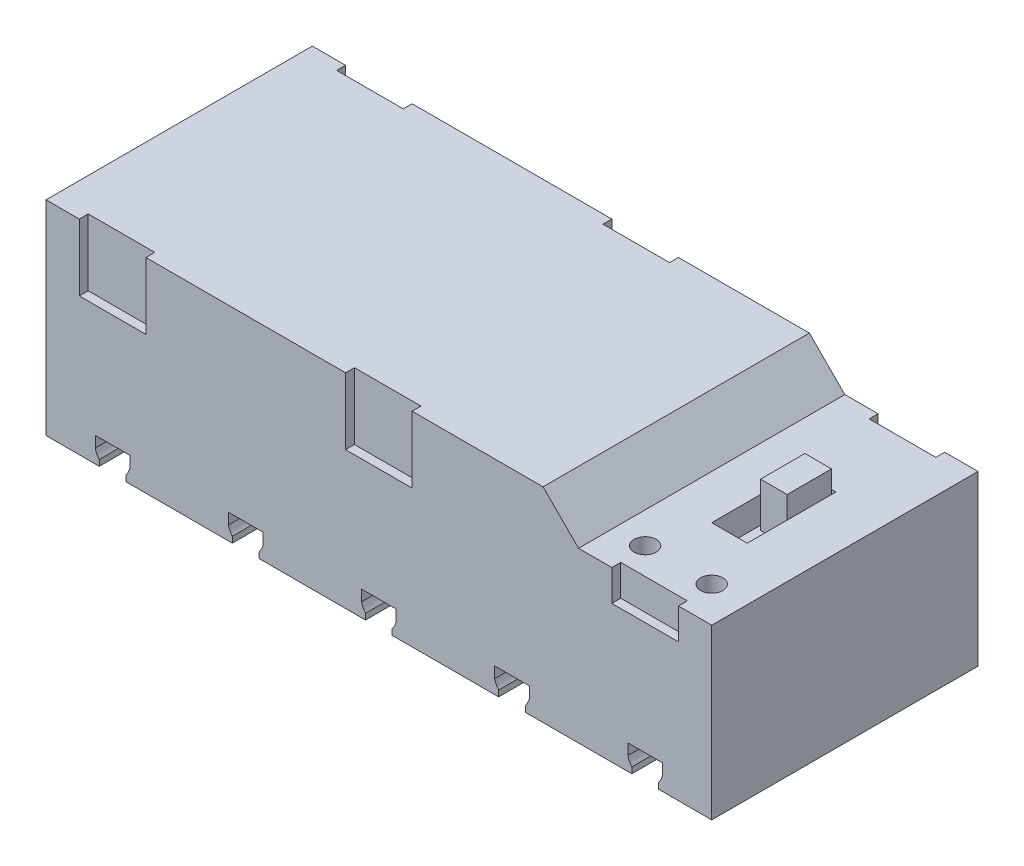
ISO-10303-21;
HEADER;
FILE_DESCRIPTION(('STEP AP214'),'2;1');
FILE_NAME('part.step','',(''),(''),'','','');
FILE_SCHEMA(('AUTOMOTIVE_DESIGN { 1 0 10303 214 1 1 1 1 }'));
ENDSEC;
DATA;
#1=APPLICATION_CONTEXT('core data for automotive mechanical design processes');
#2=APPLICATION_PROTOCOL_DEFINITION('international standard','automotive_design',2000,#1);
#3=PRODUCT_CONTEXT('',#1,'mechanical');
#4=PRODUCT('Part','Part','',(#3));
#5=PRODUCT_RELATED_PRODUCT_CATEGORY('part','',(#4));
#6=PRODUCT_DEFINITION_FORMATION('','',#4);
#7=PRODUCT_DEFINITION_CONTEXT('part definition',#1,'design');
#8=PRODUCT_DEFINITION('design','',#6,#7);
#9=PRODUCT_DEFINITION_SHAPE('','',#8);
#10=(LENGTH_UNIT() NAMED_UNIT(*) SI_UNIT(.MILLI.,.METRE.));
#11=(NAMED_UNIT(*) PLANE_ANGLE_UNIT() SI_UNIT($,.RADIAN.));
#12=(NAMED_UNIT(*) SI_UNIT($,.STERADIAN.) SOLID_ANGLE_UNIT());
#13=UNCERTAINTY_MEASURE_WITH_UNIT(LENGTH_MEASURE(1.E-05),#10,'distance_accuracy_value','');
#14=(GEOMETRIC_REPRESENTATION_CONTEXT(3) GLOBAL_UNCERTAINTY_ASSIGNED_CONTEXT((#13)) GLOBAL_UNIT_ASSIGNED_CONTEXT((#10,
#11,#12)) REPRESENTATION_CONTEXT('',''));
#15=CARTESIAN_POINT('',(0.,0.,0.));
#16=DIRECTION('',(0.,0.,1.));
#17=DIRECTION('',(1.,0.,0.));
#18=AXIS2_PLACEMENT_3D('',#15,#16,#17);
#19=CARTESIAN_POINT('',(65.,16.,-5.));
#20=DIRECTION('',(0.,0.,-1.));
#21=DIRECTION('',(-1.,0.,0.));
#22=AXIS2_PLACEMENT_3D('',#19,#20,#21);
#23=PLANE('',#22);
#24=DIRECTION('',(0.,-1.,0.));
#25=VECTOR('',#24,1.);
#26=CARTESIAN_POINT('',(65.5,21.,-5.));
#27=LINE('',#26,#25);
#28=CARTESIAN_POINT('',(65.5,19.,-5.));
#29=VERTEX_POINT('',#28);
#30=CARTESIAN_POINT('',(65.5,16.,-5.));
#31=VERTEX_POINT('',#30);
#32=EDGE_CURVE('E2089',#29,#31,#27,.T.);
#33=ORIENTED_EDGE('',*,*,#32,.F.);
#34=DIRECTION('',(-1.,0.,0.));
#35=VECTOR('',#34,1.);
#36=CARTESIAN_POINT('',(65.,19.,-5.));
#37=LINE('',#36,#35);
#38=CARTESIAN_POINT('',(65.,19.,-5.));
#39=VERTEX_POINT('',#38);
#40=EDGE_CURVE('E579',#29,#39,#37,.T.);
#41=ORIENTED_EDGE('',*,*,#40,.T.);
#42=DIRECTION('',(0.,1.,0.));
#43=VECTOR('',#42,1.);
#44=CARTESIAN_POINT('',(65.,16.,-5.));
#45=LINE('',#44,#43);
#46=CARTESIAN_POINT('',(65.,16.,-5.));
#47=VERTEX_POINT('',#46);
#48=EDGE_CURVE('E582',#47,#39,#45,.T.);
#49=ORIENTED_EDGE('',*,*,#48,.F.);
#50=DIRECTION('',(-1.,0.,0.));
#51=VECTOR('',#50,1.);
#52=CARTESIAN_POINT('',(65.,16.,-5.));
#53=LINE('',#52,#51);
#54=EDGE_CURVE('E567',#31,#47,#53,.T.);
#55=ORIENTED_EDGE('',*,*,#54,.F.);
#56=EDGE_LOOP('',(#33,#41,#49,#55));
#57=FACE_BOUND('',#56,.T.);
#58=ADVANCED_FACE('F36',(#57),#23,.F.);
#59=DIRECTION('',(0.,-1.,0.));
#60=VECTOR('',#59,1.);
#61=CARTESIAN_POINT('',(68.5,21.,-5.));
#62=LINE('',#61,#60);
#63=CARTESIAN_POINT('',(68.5,19.,-5.));
#64=VERTEX_POINT('',#63);
#65=CARTESIAN_POINT('',(68.5,16.,-5.));
#66=VERTEX_POINT('',#65);
#67=EDGE_CURVE('E2094',#64,#66,#62,.T.);
#68=ORIENTED_EDGE('',*,*,#67,.T.);
#69=CARTESIAN_POINT('',(69.,16.,-5.));
#70=VERTEX_POINT('',#69);
#71=EDGE_CURVE('E568',#70,#66,#53,.T.);
#72=ORIENTED_EDGE('',*,*,#71,.F.);
#73=DIRECTION('',(0.,1.,0.));
#74=VECTOR('',#73,1.);
#75=CARTESIAN_POINT('',(69.,16.,-5.));
#76=LINE('',#75,#74);
#77=CARTESIAN_POINT('',(69.,19.,-5.));
#78=VERTEX_POINT('',#77);
#79=EDGE_CURVE('E585',#70,#78,#76,.T.);
#80=ORIENTED_EDGE('',*,*,#79,.T.);
#81=EDGE_CURVE('E561',#78,#64,#37,.T.);
#82=ORIENTED_EDGE('',*,*,#81,.T.);
#83=EDGE_LOOP('',(#68,#72,#80,#82));
#84=FACE_BOUND('',#83,.T.);
#85=ADVANCED_FACE('F1267',(#84),#23,.F.);
#86=CARTESIAN_POINT('',(0.,15.9999999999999,0.));
#87=DIRECTION('',(0.,1.,0.));
#88=DIRECTION('',(-1.,0.,0.));
#89=AXIS2_PLACEMENT_3D('',#86,#87,#88);
#90=PLANE('',#89);
#91=DIRECTION('',(1.,0.,0.));
#92=VECTOR('',#91,1.);
#93=CARTESIAN_POINT('',(65.5,16.,0.));
#94=LINE('',#93,#92);
#95=CARTESIAN_POINT('',(65.5,16.,0.));
#96=VERTEX_POINT('',#95);
#97=CARTESIAN_POINT('',(68.5,16.,0.));
#98=VERTEX_POINT('',#97);
#99=EDGE_CURVE('E2096',#96,#98,#94,.T.);
#100=ORIENTED_EDGE('',*,*,#99,.F.);
#101=DIRECTION('',(0.,0.,1.));
#102=VECTOR('',#101,1.);
#103=CARTESIAN_POINT('',(65.5,16.,-5.));
#104=LINE('',#103,#102);
#105=EDGE_CURVE('E548',#31,#96,#104,.T.);
#106=ORIENTED_EDGE('',*,*,#105,.F.);
#107=ORIENTED_EDGE('',*,*,#54,.T.);
#108=DIRECTION('',(0.,0.,1.));
#109=VECTOR('',#108,1.);
#110=CARTESIAN_POINT('',(65.,16.,-5.));
#111=LINE('',#110,#109);
#112=CARTESIAN_POINT('',(65.,16.,5.));
#113=VERTEX_POINT('',#112);
#114=EDGE_CURVE('E557',#47,#113,#111,.T.);
#115=ORIENTED_EDGE('',*,*,#114,.T.);
#116=DIRECTION('',(1.,0.,0.));
#117=VECTOR('',#116,1.);
#118=CARTESIAN_POINT('',(65.,16.,5.));
#119=LINE('',#118,#117);
#120=CARTESIAN_POINT('',(69.,16.,5.));
#121=VERTEX_POINT('',#120);
#122=EDGE_CURVE('E560',#113,#121,#119,.T.);
#123=ORIENTED_EDGE('',*,*,#122,.T.);
#124=DIRECTION('',(0.,0.,-1.));
#125=VECTOR('',#124,1.);
#126=CARTESIAN_POINT('',(69.,16.,-5.));
#127=LINE('',#126,#125);
#128=EDGE_CURVE('E564',#121,#70,#127,.T.);
#129=ORIENTED_EDGE('',*,*,#128,.T.);
#130=ORIENTED_EDGE('',*,*,#71,.T.);
#131=DIRECTION('',(0.,0.,-1.));
#132=VECTOR('',#131,1.);
#133=CARTESIAN_POINT('',(68.5,16.,-5.));
#134=LINE('',#133,#132);
#135=EDGE_CURVE('E544',#98,#66,#134,.T.);
#136=ORIENTED_EDGE('',*,*,#135,.F.);
#137=EDGE_LOOP('',(#100,#106,#107,#115,#123,#129,#130,#136));
#138=FACE_BOUND('',#137,.T.);
#139=ADVANCED_FACE('F1273',(#138),#90,.T.);
#140=CARTESIAN_POINT('',(0.,0.,0.));
#141=DIRECTION('',(0.,-1.,0.));
#142=DIRECTION('',(0.,0.,-1.));
#143=AXIS2_PLACEMENT_3D('',#140,#141,#142);
#144=PLANE('',#143);
#145=DIRECTION('',(0.,0.,1.));
#146=VECTOR('',#145,1.);
#147=CARTESIAN_POINT('',(9.,0.,-15.));
#148=LINE('',#147,#146);
#149=CARTESIAN_POINT('',(9.,0.,-15.));
#150=VERTEX_POINT('',#149);
#151=CARTESIAN_POINT('',(9.,0.,15.));
#152=VERTEX_POINT('',#151);
#153=EDGE_CURVE('E809',#150,#152,#148,.T.);
#154=ORIENTED_EDGE('',*,*,#153,.F.);
#155=DIRECTION('',(-1.,0.,0.));
#156=VECTOR('',#155,1.);
#157=CARTESIAN_POINT('',(0.,0.,-15.));
#158=LINE('',#157,#156);
#159=CARTESIAN_POINT('',(21.,0.,-15.));
#160=VERTEX_POINT('',#159);
#161=EDGE_CURVE('E1217',#160,#150,#158,.T.);
#162=ORIENTED_EDGE('',*,*,#161,.F.);
#163=DIRECTION('',(0.,0.,1.));
#164=VECTOR('',#163,1.);
#165=CARTESIAN_POINT('',(21.,0.,-15.));
#166=LINE('',#165,#164);
#167=CARTESIAN_POINT('',(21.,0.,15.));
#168=VERTEX_POINT('',#167);
#169=EDGE_CURVE('E870',#160,#168,#166,.T.);
#170=ORIENTED_EDGE('',*,*,#169,.T.);
#171=DIRECTION('',(1.,0.,0.));
#172=VECTOR('',#171,1.);
#173=CARTESIAN_POINT('',(0.,0.,15.));
#174=LINE('',#173,#172);
#175=EDGE_CURVE('E1094',#152,#168,#174,.T.);
#176=ORIENTED_EDGE('',*,*,#175,.F.);
#177=EDGE_LOOP('',(#154,#162,#170,#176));
#178=FACE_BOUND('',#177,.T.);
#179=ADVANCED_FACE('F1444',(#178),#144,.T.);
#180=DIRECTION('',(0.,0.,1.));
#181=VECTOR('',#180,1.);
#182=CARTESIAN_POINT('',(24.,0.,-15.));
#183=LINE('',#182,#181);
#184=CARTESIAN_POINT('',(24.,0.,-15.));
#185=VERTEX_POINT('',#184);
#186=CARTESIAN_POINT('',(24.,0.,15.));
#187=VERTEX_POINT('',#186);
#188=EDGE_CURVE('E868',#185,#187,#183,.T.);
#189=ORIENTED_EDGE('',*,*,#188,.F.);
#190=CARTESIAN_POINT('',(36.,0.,-15.));
#191=VERTEX_POINT('',#190);
#192=EDGE_CURVE('E1216',#191,#185,#158,.T.);
#193=ORIENTED_EDGE('',*,*,#192,.F.);
#194=DIRECTION('',(0.,0.,1.));
#195=VECTOR('',#194,1.);
#196=CARTESIAN_POINT('',(36.,0.,-15.));
#197=LINE('',#196,#195);
#198=CARTESIAN_POINT('',(36.,0.,15.));
#199=VERTEX_POINT('',#198);
#200=EDGE_CURVE('E987',#191,#199,#197,.T.);
#201=ORIENTED_EDGE('',*,*,#200,.T.);
#202=EDGE_CURVE('E2116',#187,#199,#174,.T.);
#203=ORIENTED_EDGE('',*,*,#202,.F.);
#204=EDGE_LOOP('',(#189,#193,#201,#203));
#205=FACE_BOUND('',#204,.T.);
#206=ADVANCED_FACE('F1927',(#205),#144,.T.);
#207=DIRECTION('',(0.,0.,1.));
#208=VECTOR('',#207,1.);
#209=CARTESIAN_POINT('',(69.,0.,-15.));
#210=LINE('',#209,#208);
#211=CARTESIAN_POINT('',(69.,0.,-15.));
#212=VERTEX_POINT('',#211);
#213=CARTESIAN_POINT('',(69.,0.,15.));
#214=VERTEX_POINT('',#213);
#215=EDGE_CURVE('E926',#212,#214,#210,.T.);
#216=ORIENTED_EDGE('',*,*,#215,.F.);
#217=CARTESIAN_POINT('',(75.,0.,-15.));
#218=VERTEX_POINT('',#217);
#219=EDGE_CURVE('E1076',#218,#212,#158,.T.);
#220=ORIENTED_EDGE('',*,*,#219,.F.);
#221=DIRECTION('',(0.,0.,-1.));
#222=VECTOR('',#221,1.);
#223=CARTESIAN_POINT('',(75.,0.,15.));
#224=LINE('',#223,#222);
#225=CARTESIAN_POINT('',(75.,0.,15.));
#226=VERTEX_POINT('',#225);
#227=EDGE_CURVE('E1093',#226,#218,#224,.T.);
#228=ORIENTED_EDGE('',*,*,#227,.F.);
#229=EDGE_CURVE('E1089',#214,#226,#174,.T.);
#230=ORIENTED_EDGE('',*,*,#229,.F.);
#231=EDGE_LOOP('',(#216,#220,#228,#230));
#232=FACE_BOUND('',#231,.T.);
#233=ADVANCED_FACE('F1184',(#232),#144,.T.);
#234=DIRECTION('',(0.,0.,1.));
#235=VECTOR('',#234,1.);
#236=CARTESIAN_POINT('',(39.,0.,-15.));
#237=LINE('',#236,#235);
#238=CARTESIAN_POINT('',(39.,0.,-15.));
#239=VERTEX_POINT('',#238);
#240=CARTESIAN_POINT('',(39.,0.,15.));
#241=VERTEX_POINT('',#240);
#242=EDGE_CURVE('E985',#239,#241,#237,.T.);
#243=ORIENTED_EDGE('',*,*,#242,.F.);
#244=CARTESIAN_POINT('',(51.,0.,-15.));
#245=VERTEX_POINT('',#244);
#246=EDGE_CURVE('E1102',#245,#239,#158,.T.);
#247=ORIENTED_EDGE('',*,*,#246,.F.);
#248=DIRECTION('',(0.,0.,1.));
#249=VECTOR('',#248,1.);
#250=CARTESIAN_POINT('',(51.,0.,-15.));
#251=LINE('',#250,#249);
#252=CARTESIAN_POINT('',(51.,0.,15.));
#253=VERTEX_POINT('',#252);
#254=EDGE_CURVE('E1046',#245,#253,#251,.T.);
#255=ORIENTED_EDGE('',*,*,#254,.T.);
#256=EDGE_CURVE('E2108',#241,#253,#174,.T.);
#257=ORIENTED_EDGE('',*,*,#256,.F.);
#258=EDGE_LOOP('',(#243,#247,#255,#257));
#259=FACE_BOUND('',#258,.T.);
#260=ADVANCED_FACE('F1944',(#259),#144,.T.);
#261=DIRECTION('',(0.,0.,1.));
#262=VECTOR('',#261,1.);
#263=CARTESIAN_POINT('',(66.,0.,-15.));
#264=LINE('',#263,#262);
#265=CARTESIAN_POINT('',(66.,0.,-15.));
#266=VERTEX_POINT('',#265);
#267=CARTESIAN_POINT('',(66.,0.,15.));
#268=VERTEX_POINT('',#267);
#269=EDGE_CURVE('E928',#266,#268,#264,.T.);
#270=ORIENTED_EDGE('',*,*,#269,.T.);
#271=CARTESIAN_POINT('',(54.,0.,15.));
#272=VERTEX_POINT('',#271);
#273=EDGE_CURVE('E1095',#272,#268,#174,.T.);
#274=ORIENTED_EDGE('',*,*,#273,.F.);
#275=DIRECTION('',(0.,0.,1.));
#276=VECTOR('',#275,1.);
#277=CARTESIAN_POINT('',(54.,0.,-15.));
#278=LINE('',#277,#276);
#279=CARTESIAN_POINT('',(54.,0.,-15.));
#280=VERTEX_POINT('',#279);
#281=EDGE_CURVE('E1044',#280,#272,#278,.T.);
#282=ORIENTED_EDGE('',*,*,#281,.F.);
#283=EDGE_CURVE('E1101',#266,#280,#158,.T.);
#284=ORIENTED_EDGE('',*,*,#283,.F.);
#285=EDGE_LOOP('',(#270,#274,#282,#284));
#286=FACE_BOUND('',#285,.T.);
#287=ADVANCED_FACE('F1213',(#286),#144,.T.);
#288=CARTESIAN_POINT('',(0.,23.,15.));
#289=DIRECTION('',(1.,0.,0.));
#290=DIRECTION('',(0.,0.,-1.));
#291=AXIS2_PLACEMENT_3D('',#288,#289,#290);
#292=PLANE('',#291);
#293=DIRECTION('',(0.,0.,1.));
#294=VECTOR('',#293,1.);
#295=CARTESIAN_POINT('',(0.,0.,15.));
#296=LINE('',#295,#294);
#297=CARTESIAN_POINT('',(0.,0.,-15.));
#298=VERTEX_POINT('',#297);
#299=CARTESIAN_POINT('',(0.,0.,15.));
#300=VERTEX_POINT('',#299);
#301=EDGE_CURVE('E1069',#298,#300,#296,.T.);
#302=ORIENTED_EDGE('',*,*,#301,.T.);
#303=DIRECTION('',(0.,-1.,0.));
#304=VECTOR('',#303,1.);
#305=CARTESIAN_POINT('',(0.,23.,15.));
#306=LINE('',#305,#304);
#307=CARTESIAN_POINT('',(0.,23.,15.));
#308=VERTEX_POINT('',#307);
#309=EDGE_CURVE('E1110',#308,#300,#306,.T.);
#310=ORIENTED_EDGE('',*,*,#309,.F.);
#311=DIRECTION('',(0.,0.,1.));
#312=VECTOR('',#311,1.);
#313=CARTESIAN_POINT('',(0.,23.,15.));
#314=LINE('',#313,#312);
#315=CARTESIAN_POINT('',(0.,23.,-15.));
#316=VERTEX_POINT('',#315);
#317=EDGE_CURVE('E1072',#316,#308,#314,.T.);
#318=ORIENTED_EDGE('',*,*,#317,.F.);
#319=DIRECTION('',(0.,-1.,0.));
#320=VECTOR('',#319,1.);
#321=CARTESIAN_POINT('',(0.,23.,-15.));
#322=LINE('',#321,#320);
#323=EDGE_CURVE('E1085',#316,#298,#322,.T.);
#324=ORIENTED_EDGE('',*,*,#323,.T.);
#325=EDGE_LOOP('',(#302,#310,#318,#324));
#326=FACE_BOUND('',#325,.T.);
#327=ADVANCED_FACE('F1230',(#326),#292,.F.);
#328=CARTESIAN_POINT('',(0.,23.,15.));
#329=DIRECTION('',(0.,0.,-1.));
#330=DIRECTION('',(-1.,0.,0.));
#331=AXIS2_PLACEMENT_3D('',#328,#329,#330);
#332=PLANE('',#331);
#333=DIRECTION('',(1.,0.,0.));
#334=VECTOR('',#333,1.);
#335=CARTESIAN_POINT('',(63.75,15.5,15.));
#336=LINE('',#335,#334);
#337=CARTESIAN_POINT('',(63.75,15.5,15.));
#338=VERTEX_POINT('',#337);
#339=CARTESIAN_POINT('',(71.25,15.5,15.));
#340=VERTEX_POINT('',#339);
#341=EDGE_CURVE('E675',#338,#340,#336,.T.);
#342=ORIENTED_EDGE('',*,*,#341,.F.);
#343=DIRECTION('',(0.,1.,0.));
#344=VECTOR('',#343,1.);
#345=CARTESIAN_POINT('',(63.75,15.5,15.));
#346=LINE('',#345,#344);
#347=CARTESIAN_POINT('',(63.75,19.,15.));
#348=VERTEX_POINT('',#347);
#349=EDGE_CURVE('E695',#338,#348,#346,.T.);
#350=ORIENTED_EDGE('',*,*,#349,.T.);
#351=DIRECTION('',(1.,0.,0.));
#352=VECTOR('',#351,1.);
#353=CARTESIAN_POINT('',(75.,19.,15.));
#354=LINE('',#353,#352);
#355=CARTESIAN_POINT('',(60.,19.,15.));
#356=VERTEX_POINT('',#355);
#357=EDGE_CURVE('E1063',#356,#348,#354,.T.);
#358=ORIENTED_EDGE('',*,*,#357,.F.);
#359=DIRECTION('',(0.707106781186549,-0.707106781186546,0.));
#360=VECTOR('',#359,1.);
#361=CARTESIAN_POINT('',(60.,19.,15.));
#362=LINE('',#361,#360);
#363=CARTESIAN_POINT('',(56.,23.,15.));
#364=VERTEX_POINT('',#363);
#365=EDGE_CURVE('E1113',#356,#364,#362,.F.);
#366=ORIENTED_EDGE('',*,*,#365,.T.);
#367=DIRECTION('',(1.,0.,0.));
#368=VECTOR('',#367,1.);
#369=CARTESIAN_POINT('',(0.,23.,15.));
#370=LINE('',#369,#368);
#371=CARTESIAN_POINT('',(41.25,23.,15.));
#372=VERTEX_POINT('',#371);
#373=EDGE_CURVE('E1075',#372,#364,#370,.T.);
#374=ORIENTED_EDGE('',*,*,#373,.F.);
#375=DIRECTION('',(0.,1.,0.));
#376=VECTOR('',#375,1.);
#377=CARTESIAN_POINT('',(41.25,15.5,15.));
#378=LINE('',#377,#376);
#379=CARTESIAN_POINT('',(41.25,15.5,15.));
#380=VERTEX_POINT('',#379);
#381=EDGE_CURVE('E761',#380,#372,#378,.T.);
#382=ORIENTED_EDGE('',*,*,#381,.F.);
#383=DIRECTION('',(1.,0.,0.));
#384=VECTOR('',#383,1.);
#385=CARTESIAN_POINT('',(33.75,15.5,15.));
#386=LINE('',#385,#384);
#387=CARTESIAN_POINT('',(33.75,15.5,15.));
#388=VERTEX_POINT('',#387);
#389=EDGE_CURVE('E738',#388,#380,#386,.T.);
#390=ORIENTED_EDGE('',*,*,#389,.F.);
#391=DIRECTION('',(0.,1.,0.));
#392=VECTOR('',#391,1.);
#393=CARTESIAN_POINT('',(33.75,15.5,15.));
#394=LINE('',#393,#392);
#395=CARTESIAN_POINT('',(33.75,23.,15.));
#396=VERTEX_POINT('',#395);
#397=EDGE_CURVE('E748',#388,#396,#394,.T.);
#398=ORIENTED_EDGE('',*,*,#397,.T.);
#399=CARTESIAN_POINT('',(11.25,23.,15.));
#400=VERTEX_POINT('',#399);
#401=EDGE_CURVE('E1081',#400,#396,#370,.T.);
#402=ORIENTED_EDGE('',*,*,#401,.F.);
#403=DIRECTION('',(0.,1.,0.));
#404=VECTOR('',#403,1.);
#405=CARTESIAN_POINT('',(11.25,15.5,15.));
#406=LINE('',#405,#404);
#407=CARTESIAN_POINT('',(11.25,15.5,15.));
#408=VERTEX_POINT('',#407);
#409=EDGE_CURVE('E719',#408,#400,#406,.T.);
#410=ORIENTED_EDGE('',*,*,#409,.F.);
#411=DIRECTION('',(1.,0.,0.));
#412=VECTOR('',#411,1.);
#413=CARTESIAN_POINT('',(3.75,15.5,15.));
#414=LINE('',#413,#412);
#415=CARTESIAN_POINT('',(3.75,15.5,15.));
#416=VERTEX_POINT('',#415);
#417=EDGE_CURVE('E706',#416,#408,#414,.T.);
#418=ORIENTED_EDGE('',*,*,#417,.F.);
#419=DIRECTION('',(0.,1.,0.));
#420=VECTOR('',#419,1.);
#421=CARTESIAN_POINT('',(3.75,15.5,15.));
#422=LINE('',#421,#420);
#423=CARTESIAN_POINT('',(3.75,23.,15.));
#424=VERTEX_POINT('',#423);
#425=EDGE_CURVE('E726',#416,#424,#422,.T.);
#426=ORIENTED_EDGE('',*,*,#425,.T.);
#427=EDGE_CURVE('E1077',#308,#424,#370,.T.);
#428=ORIENTED_EDGE('',*,*,#427,.F.);
#429=ORIENTED_EDGE('',*,*,#309,.T.);
#430=CARTESIAN_POINT('',(6.,0.,15.));
#431=VERTEX_POINT('',#430);
#432=EDGE_CURVE('E1090',#300,#431,#174,.T.);
#433=ORIENTED_EDGE('',*,*,#432,.T.);
#434=DIRECTION('',(0.,-1.,0.));
#435=VECTOR('',#434,1.);
#436=CARTESIAN_POINT('',(6.,0.,15.));
#437=LINE('',#436,#435);
#438=CARTESIAN_POINT('',(6.,0.677124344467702,15.));
#439=VERTEX_POINT('',#438);
#440=EDGE_CURVE('E802',#439,#431,#437,.T.);
#441=ORIENTED_EDGE('',*,*,#440,.F.);
#442=CARTESIAN_POINT('',(7.5,2.,15.));
#443=DIRECTION('',(0.,0.,1.));
#444=DIRECTION('',(1.,0.,0.));
#445=AXIS2_PLACEMENT_3D('',#442,#443,#444);
#446=CIRCLE('',#445,2.);
#447=CARTESIAN_POINT('',(5.55,1.55559027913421,15.));
#448=VERTEX_POINT('',#447);
#449=EDGE_CURVE('E799',#448,#439,#446,.T.);
#450=ORIENTED_EDGE('',*,*,#449,.F.);
#451=DIRECTION('',(0.,-1.,0.));
#452=VECTOR('',#451,1.);
#453=CARTESIAN_POINT('',(5.55,2.8,15.));
#454=LINE('',#453,#452);
#455=CARTESIAN_POINT('',(5.55,2.8,15.));
#456=VERTEX_POINT('',#455);
#457=EDGE_CURVE('E796',#456,#448,#454,.T.);
#458=ORIENTED_EDGE('',*,*,#457,.F.);
#459=DIRECTION('',(-1.,0.,0.));
#460=VECTOR('',#459,1.);
#461=CARTESIAN_POINT('',(5.55,2.8,15.));
#462=LINE('',#461,#460);
#463=CARTESIAN_POINT('',(9.45000000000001,2.8,15.));
#464=VERTEX_POINT('',#463);
#465=EDGE_CURVE('E793',#464,#456,#462,.T.);
#466=ORIENTED_EDGE('',*,*,#465,.F.);
#467=DIRECTION('',(0.,1.,0.));
#468=VECTOR('',#467,1.);
#469=CARTESIAN_POINT('',(9.45000000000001,2.8,15.));
#470=LINE('',#469,#468);
#471=CARTESIAN_POINT('',(9.45000000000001,1.55559027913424,15.));
#472=VERTEX_POINT('',#471);
#473=EDGE_CURVE('E790',#472,#464,#470,.T.);
#474=ORIENTED_EDGE('',*,*,#473,.F.);
#475=CARTESIAN_POINT('',(7.5,2.,15.));
#476=DIRECTION('',(0.,0.,1.));
#477=DIRECTION('',(1.,0.,0.));
#478=AXIS2_PLACEMENT_3D('',#475,#476,#477);
#479=CIRCLE('',#478,2.);
#480=CARTESIAN_POINT('',(9.,0.677124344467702,15.));
#481=VERTEX_POINT('',#480);
#482=EDGE_CURVE('E758',#481,#472,#479,.T.);
#483=ORIENTED_EDGE('',*,*,#482,.F.);
#484=DIRECTION('',(0.,1.,0.));
#485=VECTOR('',#484,1.);
#486=CARTESIAN_POINT('',(9.,0.,15.));
#487=LINE('',#486,#485);
#488=EDGE_CURVE('E769',#152,#481,#487,.T.);
#489=ORIENTED_EDGE('',*,*,#488,.F.);
#490=ORIENTED_EDGE('',*,*,#175,.T.);
#491=DIRECTION('',(0.,-1.,0.));
#492=VECTOR('',#491,1.);
#493=CARTESIAN_POINT('',(21.,0.,15.));
#494=LINE('',#493,#492);
#495=CARTESIAN_POINT('',(21.,0.677124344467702,15.));
#496=VERTEX_POINT('',#495);
#497=EDGE_CURVE('E860',#496,#168,#494,.T.);
#498=ORIENTED_EDGE('',*,*,#497,.F.);
#499=CARTESIAN_POINT('',(22.5,2.,15.));
#500=DIRECTION('',(0.,0.,1.));
#501=DIRECTION('',(1.,0.,0.));
#502=AXIS2_PLACEMENT_3D('',#499,#500,#501);
#503=CIRCLE('',#502,2.);
#504=CARTESIAN_POINT('',(20.55,1.55559027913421,15.));
#505=VERTEX_POINT('',#504);
#506=EDGE_CURVE('E857',#505,#496,#503,.T.);
#507=ORIENTED_EDGE('',*,*,#506,.F.);
#508=DIRECTION('',(0.,-1.,0.));
#509=VECTOR('',#508,1.);
#510=CARTESIAN_POINT('',(20.55,2.8,15.));
#511=LINE('',#510,#509);
#512=CARTESIAN_POINT('',(20.55,2.8,15.));
#513=VERTEX_POINT('',#512);
#514=EDGE_CURVE('E854',#513,#505,#511,.T.);
#515=ORIENTED_EDGE('',*,*,#514,.F.);
#516=DIRECTION('',(-1.,0.,0.));
#517=VECTOR('',#516,1.);
#518=CARTESIAN_POINT('',(20.55,2.8,15.));
#519=LINE('',#518,#517);
#520=CARTESIAN_POINT('',(24.45,2.8,15.));
#521=VERTEX_POINT('',#520);
#522=EDGE_CURVE('E851',#521,#513,#519,.T.);
#523=ORIENTED_EDGE('',*,*,#522,.F.);
#524=DIRECTION('',(0.,1.,0.));
#525=VECTOR('',#524,1.);
#526=CARTESIAN_POINT('',(24.45,2.8,15.));
#527=LINE('',#526,#525);
#528=CARTESIAN_POINT('',(24.45,1.55559027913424,15.));
#529=VERTEX_POINT('',#528);
#530=EDGE_CURVE('E848',#529,#521,#527,.T.);
#531=ORIENTED_EDGE('',*,*,#530,.F.);
#532=CARTESIAN_POINT('',(22.5,2.,15.));
#533=DIRECTION('',(0.,0.,1.));
#534=DIRECTION('',(1.,0.,0.));
#535=AXIS2_PLACEMENT_3D('',#532,#533,#534);
#536=CIRCLE('',#535,2.);
#537=CARTESIAN_POINT('',(24.,0.677124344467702,15.));
#538=VERTEX_POINT('',#537);
#539=EDGE_CURVE('E808',#538,#529,#536,.T.);
#540=ORIENTED_EDGE('',*,*,#539,.F.);
#541=DIRECTION('',(0.,1.,0.));
#542=VECTOR('',#541,1.);
#543=CARTESIAN_POINT('',(24.,0.,15.));
#544=LINE('',#543,#542);
#545=EDGE_CURVE('E827',#187,#538,#544,.T.);
#546=ORIENTED_EDGE('',*,*,#545,.F.);
#547=ORIENTED_EDGE('',*,*,#202,.T.);
#548=DIRECTION('',(0.,-1.,0.));
#549=VECTOR('',#548,1.);
#550=CARTESIAN_POINT('',(36.,0.,15.));
#551=LINE('',#550,#549);
#552=CARTESIAN_POINT('',(36.,0.677124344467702,15.));
#553=VERTEX_POINT('',#552);
#554=EDGE_CURVE('E977',#553,#199,#551,.T.);
#555=ORIENTED_EDGE('',*,*,#554,.F.);
#556=CARTESIAN_POINT('',(37.5,2.,15.));
#557=DIRECTION('',(0.,0.,1.));
#558=DIRECTION('',(1.,0.,0.));
#559=AXIS2_PLACEMENT_3D('',#556,#557,#558);
#560=CIRCLE('',#559,2.);
#561=CARTESIAN_POINT('',(35.55,1.55559027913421,15.));
#562=VERTEX_POINT('',#561);
#563=EDGE_CURVE('E974',#562,#553,#560,.T.);
#564=ORIENTED_EDGE('',*,*,#563,.F.);
#565=DIRECTION('',(0.,-1.,0.));
#566=VECTOR('',#565,1.);
#567=CARTESIAN_POINT('',(35.55,2.8,15.));
#568=LINE('',#567,#566);
#569=CARTESIAN_POINT('',(35.55,2.8,15.));
#570=VERTEX_POINT('',#569);
#571=EDGE_CURVE('E971',#570,#562,#568,.T.);
#572=ORIENTED_EDGE('',*,*,#571,.F.);
#573=DIRECTION('',(-1.,0.,0.));
#574=VECTOR('',#573,1.);
#575=CARTESIAN_POINT('',(35.55,2.8,15.));
#576=LINE('',#575,#574);
#577=CARTESIAN_POINT('',(39.45,2.8,15.));
#578=VERTEX_POINT('',#577);
#579=EDGE_CURVE('E968',#578,#570,#576,.T.);
#580=ORIENTED_EDGE('',*,*,#579,.F.);
#581=DIRECTION('',(0.,1.,0.));
#582=VECTOR('',#581,1.);
#583=CARTESIAN_POINT('',(39.45,2.8,15.));
#584=LINE('',#583,#582);
#585=CARTESIAN_POINT('',(39.45,1.55559027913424,15.));
#586=VERTEX_POINT('',#585);
#587=EDGE_CURVE('E965',#586,#578,#584,.T.);
#588=ORIENTED_EDGE('',*,*,#587,.F.);
#589=CARTESIAN_POINT('',(37.5,2.,15.));
#590=DIRECTION('',(0.,0.,1.));
#591=DIRECTION('',(1.,0.,0.));
#592=AXIS2_PLACEMENT_3D('',#589,#590,#591);
#593=CIRCLE('',#592,2.);
#594=CARTESIAN_POINT('',(39.,0.677124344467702,15.));
#595=VERTEX_POINT('',#594);
#596=EDGE_CURVE('E925',#595,#586,#593,.T.);
#597=ORIENTED_EDGE('',*,*,#596,.F.);
#598=DIRECTION('',(0.,1.,0.));
#599=VECTOR('',#598,1.);
#600=CARTESIAN_POINT('',(39.,0.,15.));
#601=LINE('',#600,#599);
#602=EDGE_CURVE('E944',#241,#595,#601,.T.);
#603=ORIENTED_EDGE('',*,*,#602,.F.);
#604=ORIENTED_EDGE('',*,*,#256,.T.);
#605=DIRECTION('',(0.,-1.,0.));
#606=VECTOR('',#605,1.);
#607=CARTESIAN_POINT('',(51.,0.,15.));
#608=LINE('',#607,#606);
#609=CARTESIAN_POINT('',(51.,0.677124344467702,15.));
#610=VERTEX_POINT('',#609);
#611=EDGE_CURVE('E1036',#610,#253,#608,.T.);
#612=ORIENTED_EDGE('',*,*,#611,.F.);
#613=CARTESIAN_POINT('',(52.5,2.,15.));
#614=DIRECTION('',(0.,0.,1.));
#615=DIRECTION('',(1.,0.,0.));
#616=AXIS2_PLACEMENT_3D('',#613,#614,#615);
#617=CIRCLE('',#616,2.);
#618=CARTESIAN_POINT('',(50.55,1.55559027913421,15.));
#619=VERTEX_POINT('',#618);
#620=EDGE_CURVE('E1033',#619,#610,#617,.T.);
#621=ORIENTED_EDGE('',*,*,#620,.F.);
#622=DIRECTION('',(0.,-1.,0.));
#623=VECTOR('',#622,1.);
#624=CARTESIAN_POINT('',(50.55,2.8,15.));
#625=LINE('',#624,#623);
#626=CARTESIAN_POINT('',(50.55,2.8,15.));
#627=VERTEX_POINT('',#626);
#628=EDGE_CURVE('E1030',#627,#619,#625,.T.);
#629=ORIENTED_EDGE('',*,*,#628,.F.);
#630=DIRECTION('',(-1.,0.,0.));
#631=VECTOR('',#630,1.);
#632=CARTESIAN_POINT('',(50.55,2.8,15.));
#633=LINE('',#632,#631);
#634=CARTESIAN_POINT('',(54.45,2.8,15.));
#635=VERTEX_POINT('',#634);
#636=EDGE_CURVE('E1027',#635,#627,#633,.T.);
#637=ORIENTED_EDGE('',*,*,#636,.F.);
#638=DIRECTION('',(0.,1.,0.));
#639=VECTOR('',#638,1.);
#640=CARTESIAN_POINT('',(54.45,2.8,15.));
#641=LINE('',#640,#639);
#642=CARTESIAN_POINT('',(54.45,1.55559027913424,15.));
#643=VERTEX_POINT('',#642);
#644=EDGE_CURVE('E1024',#643,#635,#641,.T.);
#645=ORIENTED_EDGE('',*,*,#644,.F.);
#646=CARTESIAN_POINT('',(52.5,2.,15.));
#647=DIRECTION('',(0.,0.,1.));
#648=DIRECTION('',(1.,0.,0.));
#649=AXIS2_PLACEMENT_3D('',#646,#647,#648);
#650=CIRCLE('',#649,2.);
#651=CARTESIAN_POINT('',(54.,0.677124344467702,15.));
#652=VERTEX_POINT('',#651);
#653=EDGE_CURVE('E984',#652,#643,#650,.T.);
#654=ORIENTED_EDGE('',*,*,#653,.F.);
#655=DIRECTION('',(0.,1.,0.));
#656=VECTOR('',#655,1.);
#657=CARTESIAN_POINT('',(54.,0.,15.));
#658=LINE('',#657,#656);
#659=EDGE_CURVE('E1003',#272,#652,#658,.T.);
#660=ORIENTED_EDGE('',*,*,#659,.F.);
#661=ORIENTED_EDGE('',*,*,#273,.T.);
#662=DIRECTION('',(0.,-1.,0.));
#663=VECTOR('',#662,1.);
#664=CARTESIAN_POINT('',(66.,0.,15.));
#665=LINE('',#664,#663);
#666=CARTESIAN_POINT('',(66.,0.677124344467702,15.));
#667=VERTEX_POINT('',#666);
#668=EDGE_CURVE('E919',#667,#268,#665,.T.);
#669=ORIENTED_EDGE('',*,*,#668,.F.);
#670=CARTESIAN_POINT('',(67.5,2.,15.));
#671=DIRECTION('',(0.,0.,1.));
#672=DIRECTION('',(1.,0.,0.));
#673=AXIS2_PLACEMENT_3D('',#670,#671,#672);
#674=CIRCLE('',#673,2.00000000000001);
#675=CARTESIAN_POINT('',(65.55,1.55559027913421,15.));
#676=VERTEX_POINT('',#675);
#677=EDGE_CURVE('E916',#676,#667,#674,.T.);
#678=ORIENTED_EDGE('',*,*,#677,.F.);
#679=DIRECTION('',(0.,-1.,0.));
#680=VECTOR('',#679,1.);
#681=CARTESIAN_POINT('',(65.55,2.8,15.));
#682=LINE('',#681,#680);
#683=CARTESIAN_POINT('',(65.55,2.8,15.));
#684=VERTEX_POINT('',#683);
#685=EDGE_CURVE('E913',#684,#676,#682,.T.);
#686=ORIENTED_EDGE('',*,*,#685,.F.);
#687=DIRECTION('',(-1.,0.,0.));
#688=VECTOR('',#687,1.);
#689=CARTESIAN_POINT('',(65.55,2.8,15.));
#690=LINE('',#689,#688);
#691=CARTESIAN_POINT('',(69.45,2.8,15.));
#692=VERTEX_POINT('',#691);
#693=EDGE_CURVE('E910',#692,#684,#690,.T.);
#694=ORIENTED_EDGE('',*,*,#693,.F.);
#695=DIRECTION('',(0.,1.,0.));
#696=VECTOR('',#695,1.);
#697=CARTESIAN_POINT('',(69.45,2.8,15.));
#698=LINE('',#697,#696);
#699=CARTESIAN_POINT('',(69.45,1.55559027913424,15.));
#700=VERTEX_POINT('',#699);
#701=EDGE_CURVE('E907',#700,#692,#698,.T.);
#702=ORIENTED_EDGE('',*,*,#701,.F.);
#703=CARTESIAN_POINT('',(67.5,2.,15.));
#704=DIRECTION('',(0.,0.,1.));
#705=DIRECTION('',(1.,0.,0.));
#706=AXIS2_PLACEMENT_3D('',#703,#704,#705);
#707=CIRCLE('',#706,2.);
#708=CARTESIAN_POINT('',(69.,0.677124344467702,15.));
#709=VERTEX_POINT('',#708);
#710=EDGE_CURVE('E867',#709,#700,#707,.T.);
#711=ORIENTED_EDGE('',*,*,#710,.F.);
#712=DIRECTION('',(0.,1.,0.));
#713=VECTOR('',#712,1.);
#714=CARTESIAN_POINT('',(69.,0.,15.));
#715=LINE('',#714,#713);
#716=EDGE_CURVE('E886',#214,#709,#715,.T.);
#717=ORIENTED_EDGE('',*,*,#716,.F.);
#718=ORIENTED_EDGE('',*,*,#229,.T.);
#719=DIRECTION('',(0.,-1.,0.));
#720=VECTOR('',#719,1.);
#721=CARTESIAN_POINT('',(75.,23.,15.));
#722=LINE('',#721,#720);
#723=CARTESIAN_POINT('',(75.,19.,15.));
#724=VERTEX_POINT('',#723);
#725=EDGE_CURVE('E1107',#724,#226,#722,.T.);
#726=ORIENTED_EDGE('',*,*,#725,.F.);
#727=CARTESIAN_POINT('',(71.25,19.,15.));
#728=VERTEX_POINT('',#727);
#729=EDGE_CURVE('E1043',#728,#724,#354,.T.);
#730=ORIENTED_EDGE('',*,*,#729,.F.);
#731=DIRECTION('',(0.,1.,0.));
#732=VECTOR('',#731,1.);
#733=CARTESIAN_POINT('',(71.25,15.5,15.));
#734=LINE('',#733,#732);
#735=EDGE_CURVE('E694',#340,#728,#734,.T.);
#736=ORIENTED_EDGE('',*,*,#735,.F.);
#737=EDGE_LOOP('',(#342,#350,#358,#366,#374,#382,#390,#398,#402,#410,#418,#426,#428,#429,#433,
#441,#450,#458,#466,#474,#483,#489,#490,#498,#507,#515,#523,#531,#540,#546,#547,#555,#564,#572,
#580,#588,#597,#603,#604,#612,#621,#629,#637,#645,#654,#660,#661,#669,#678,#686,#694,#702,#711,
#717,#718,#726,#730,#736));
#738=FACE_BOUND('',#737,.T.);
#739=ADVANCED_FACE('F1161',(#738),#332,.F.);
#740=CARTESIAN_POINT('',(75.,23.,15.));
#741=DIRECTION('',(-1.,0.,0.));
#742=DIRECTION('',(0.,0.,1.));
#743=AXIS2_PLACEMENT_3D('',#740,#741,#742);
#744=PLANE('',#743);
#745=DIRECTION('',(0.,-1.,0.));
#746=VECTOR('',#745,1.);
#747=CARTESIAN_POINT('',(75.,23.,-15.));
#748=LINE('',#747,#746);
#749=CARTESIAN_POINT('',(75.,19.,-15.));
#750=VERTEX_POINT('',#749);
#751=EDGE_CURVE('E1105',#750,#218,#748,.T.);
#752=ORIENTED_EDGE('',*,*,#751,.F.);
#753=DIRECTION('',(0.,0.,1.));
#754=VECTOR('',#753,1.);
#755=CARTESIAN_POINT('',(75.,19.,-15.));
#756=LINE('',#755,#754);
#757=EDGE_CURVE('E1066',#750,#724,#756,.T.);
#758=ORIENTED_EDGE('',*,*,#757,.T.);
#759=ORIENTED_EDGE('',*,*,#725,.T.);
#760=ORIENTED_EDGE('',*,*,#227,.T.);
#761=EDGE_LOOP('',(#752,#758,#759,#760));
#762=FACE_BOUND('',#761,.T.);
#763=ADVANCED_FACE('F1180',(#762),#744,.F.);
#764=CARTESIAN_POINT('',(0.,23.,-15.));
#765=DIRECTION('',(0.,0.,1.));
#766=DIRECTION('',(1.,0.,0.));
#767=AXIS2_PLACEMENT_3D('',#764,#765,#766);
#768=PLANE('',#767);
#769=DIRECTION('',(-1.,0.,0.));
#770=VECTOR('',#769,1.);
#771=CARTESIAN_POINT('',(33.75,15.5,-15.));
#772=LINE('',#771,#770);
#773=CARTESIAN_POINT('',(41.25,15.5,-15.));
#774=VERTEX_POINT('',#773);
#775=CARTESIAN_POINT('',(33.75,15.5,-15.));
#776=VERTEX_POINT('',#775);
#777=EDGE_CURVE('E602',#774,#776,#772,.T.);
#778=ORIENTED_EDGE('',*,*,#777,.F.);
#779=DIRECTION('',(0.,1.,0.));
#780=VECTOR('',#779,1.);
#781=CARTESIAN_POINT('',(41.25,15.5,-15.));
#782=LINE('',#781,#780);
#783=CARTESIAN_POINT('',(41.25,23.,-15.));
#784=VERTEX_POINT('',#783);
#785=EDGE_CURVE('E622',#774,#784,#782,.T.);
#786=ORIENTED_EDGE('',*,*,#785,.T.);
#787=DIRECTION('',(-1.,0.,0.));
#788=VECTOR('',#787,1.);
#789=CARTESIAN_POINT('',(0.,23.,-15.));
#790=LINE('',#789,#788);
#791=CARTESIAN_POINT('',(56.,23.,-15.));
#792=VERTEX_POINT('',#791);
#793=EDGE_CURVE('E1082',#792,#784,#790,.T.);
#794=ORIENTED_EDGE('',*,*,#793,.F.);
#795=DIRECTION('',(-0.707106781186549,0.707106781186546,0.));
#796=VECTOR('',#795,1.);
#797=CARTESIAN_POINT('',(60.,19.,-15.));
#798=LINE('',#797,#796);
#799=CARTESIAN_POINT('',(60.,19.,-15.));
#800=VERTEX_POINT('',#799);
#801=EDGE_CURVE('E1118',#792,#800,#798,.F.);
#802=ORIENTED_EDGE('',*,*,#801,.T.);
#803=DIRECTION('',(1.,0.,0.));
#804=VECTOR('',#803,1.);
#805=CARTESIAN_POINT('',(75.,19.,-15.));
#806=LINE('',#805,#804);
#807=CARTESIAN_POINT('',(63.75,19.,-15.));
#808=VERTEX_POINT('',#807);
#809=EDGE_CURVE('E1058',#800,#808,#806,.T.);
#810=ORIENTED_EDGE('',*,*,#809,.T.);
#811=DIRECTION('',(0.,1.,0.));
#812=VECTOR('',#811,1.);
#813=CARTESIAN_POINT('',(63.75,15.5,-15.));
#814=LINE('',#813,#812);
#815=CARTESIAN_POINT('',(63.75,15.5,-15.));
#816=VERTEX_POINT('',#815);
#817=EDGE_CURVE('E673',#816,#808,#814,.T.);
#818=ORIENTED_EDGE('',*,*,#817,.F.);
#819=DIRECTION('',(-1.,0.,0.));
#820=VECTOR('',#819,1.);
#821=CARTESIAN_POINT('',(63.75,15.5,-15.));
#822=LINE('',#821,#820);
#823=CARTESIAN_POINT('',(71.25,15.5,-15.));
#824=VERTEX_POINT('',#823);
#825=EDGE_CURVE('E669',#824,#816,#822,.T.);
#826=ORIENTED_EDGE('',*,*,#825,.F.);
#827=DIRECTION('',(0.,1.,0.));
#828=VECTOR('',#827,1.);
#829=CARTESIAN_POINT('',(71.25,15.5,-15.));
#830=LINE('',#829,#828);
#831=CARTESIAN_POINT('',(71.25,19.,-15.));
#832=VERTEX_POINT('',#831);
#833=EDGE_CURVE('E676',#824,#832,#830,.T.);
#834=ORIENTED_EDGE('',*,*,#833,.T.);
#835=EDGE_CURVE('E1062',#832,#750,#806,.T.);
#836=ORIENTED_EDGE('',*,*,#835,.T.);
#837=ORIENTED_EDGE('',*,*,#751,.T.);
#838=ORIENTED_EDGE('',*,*,#219,.T.);
#839=DIRECTION('',(0.,1.,0.));
#840=VECTOR('',#839,1.);
#841=CARTESIAN_POINT('',(69.,0.,-15.));
#842=LINE('',#841,#840);
#843=CARTESIAN_POINT('',(69.,0.677124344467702,-15.));
#844=VERTEX_POINT('',#843);
#845=EDGE_CURVE('E901',#212,#844,#842,.T.);
#846=ORIENTED_EDGE('',*,*,#845,.T.);
#847=CARTESIAN_POINT('',(67.5,2.,-15.));
#848=DIRECTION('',(0.,0.,1.));
#849=DIRECTION('',(1.,0.,0.));
#850=AXIS2_PLACEMENT_3D('',#847,#848,#849);
#851=CIRCLE('',#850,2.);
#852=CARTESIAN_POINT('',(69.45,1.55559027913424,-15.));
#853=VERTEX_POINT('',#852);
#854=EDGE_CURVE('E882',#844,#853,#851,.T.);
#855=ORIENTED_EDGE('',*,*,#854,.T.);
#856=DIRECTION('',(0.,1.,0.));
#857=VECTOR('',#856,1.);
#858=CARTESIAN_POINT('',(69.45,2.8,-15.));
#859=LINE('',#858,#857);
#860=CARTESIAN_POINT('',(69.45,2.8,-15.));
#861=VERTEX_POINT('',#860);
#862=EDGE_CURVE('E885',#853,#861,#859,.T.);
#863=ORIENTED_EDGE('',*,*,#862,.T.);
#864=DIRECTION('',(-1.,0.,0.));
#865=VECTOR('',#864,1.);
#866=CARTESIAN_POINT('',(65.55,2.8,-15.));
#867=LINE('',#866,#865);
#868=CARTESIAN_POINT('',(65.55,2.8,-15.));
#869=VERTEX_POINT('',#868);
#870=EDGE_CURVE('E889',#861,#869,#867,.T.);
#871=ORIENTED_EDGE('',*,*,#870,.T.);
#872=DIRECTION('',(0.,-1.,0.));
#873=VECTOR('',#872,1.);
#874=CARTESIAN_POINT('',(65.55,2.8,-15.));
#875=LINE('',#874,#873);
#876=CARTESIAN_POINT('',(65.55,1.55559027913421,-15.));
#877=VERTEX_POINT('',#876);
#878=EDGE_CURVE('E892',#869,#877,#875,.T.);
#879=ORIENTED_EDGE('',*,*,#878,.T.);
#880=CARTESIAN_POINT('',(67.5,2.,-15.));
#881=DIRECTION('',(0.,0.,1.));
#882=DIRECTION('',(1.,0.,0.));
#883=AXIS2_PLACEMENT_3D('',#880,#881,#882);
#884=CIRCLE('',#883,2.00000000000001);
#885=CARTESIAN_POINT('',(66.,0.677124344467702,-15.));
#886=VERTEX_POINT('',#885);
#887=EDGE_CURVE('E895',#877,#886,#884,.T.);
#888=ORIENTED_EDGE('',*,*,#887,.T.);
#889=DIRECTION('',(0.,-1.,0.));
#890=VECTOR('',#889,1.);
#891=CARTESIAN_POINT('',(66.,0.,-15.));
#892=LINE('',#891,#890);
#893=EDGE_CURVE('E898',#886,#266,#892,.T.);
#894=ORIENTED_EDGE('',*,*,#893,.T.);
#895=ORIENTED_EDGE('',*,*,#283,.T.);
#896=DIRECTION('',(0.,1.,0.));
#897=VECTOR('',#896,1.);
#898=CARTESIAN_POINT('',(54.,0.,-15.));
#899=LINE('',#898,#897);
#900=CARTESIAN_POINT('',(54.,0.677124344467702,-15.));
#901=VERTEX_POINT('',#900);
#902=EDGE_CURVE('E1018',#280,#901,#899,.T.);
#903=ORIENTED_EDGE('',*,*,#902,.T.);
#904=CARTESIAN_POINT('',(52.5,2.,-15.));
#905=DIRECTION('',(0.,0.,1.));
#906=DIRECTION('',(1.,0.,0.));
#907=AXIS2_PLACEMENT_3D('',#904,#905,#906);
#908=CIRCLE('',#907,2.);
#909=CARTESIAN_POINT('',(54.45,1.55559027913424,-15.));
#910=VERTEX_POINT('',#909);
#911=EDGE_CURVE('E999',#901,#910,#908,.T.);
#912=ORIENTED_EDGE('',*,*,#911,.T.);
#913=DIRECTION('',(0.,1.,0.));
#914=VECTOR('',#913,1.);
#915=CARTESIAN_POINT('',(54.45,2.8,-15.));
#916=LINE('',#915,#914);
#917=CARTESIAN_POINT('',(54.45,2.8,-15.));
#918=VERTEX_POINT('',#917);
#919=EDGE_CURVE('E1002',#910,#918,#916,.T.);
#920=ORIENTED_EDGE('',*,*,#919,.T.);
#921=DIRECTION('',(-1.,0.,0.));
#922=VECTOR('',#921,1.);
#923=CARTESIAN_POINT('',(50.55,2.8,-15.));
#924=LINE('',#923,#922);
#925=CARTESIAN_POINT('',(50.55,2.8,-15.));
#926=VERTEX_POINT('',#925);
#927=EDGE_CURVE('E1006',#918,#926,#924,.T.);
#928=ORIENTED_EDGE('',*,*,#927,.T.);
#929=DIRECTION('',(0.,-1.,0.));
#930=VECTOR('',#929,1.);
#931=CARTESIAN_POINT('',(50.55,2.8,-15.));
#932=LINE('',#931,#930);
#933=CARTESIAN_POINT('',(50.55,1.55559027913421,-15.));
#934=VERTEX_POINT('',#933);
#935=EDGE_CURVE('E1009',#926,#934,#932,.T.);
#936=ORIENTED_EDGE('',*,*,#935,.T.);
#937=CARTESIAN_POINT('',(52.5,2.,-15.));
#938=DIRECTION('',(0.,0.,1.));
#939=DIRECTION('',(1.,0.,0.));
#940=AXIS2_PLACEMENT_3D('',#937,#938,#939);
#941=CIRCLE('',#940,2.);
#942=CARTESIAN_POINT('',(51.,0.677124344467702,-15.));
#943=VERTEX_POINT('',#942);
#944=EDGE_CURVE('E1012',#934,#943,#941,.T.);
#945=ORIENTED_EDGE('',*,*,#944,.T.);
#946=DIRECTION('',(0.,-1.,0.));
#947=VECTOR('',#946,1.);
#948=CARTESIAN_POINT('',(51.,0.,-15.));
#949=LINE('',#948,#947);
#950=EDGE_CURVE('E1015',#943,#245,#949,.T.);
#951=ORIENTED_EDGE('',*,*,#950,.T.);
#952=ORIENTED_EDGE('',*,*,#246,.T.);
#953=DIRECTION('',(0.,1.,0.));
#954=VECTOR('',#953,1.);
#955=CARTESIAN_POINT('',(39.,0.,-15.));
#956=LINE('',#955,#954);
#957=CARTESIAN_POINT('',(39.,0.677124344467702,-15.));
#958=VERTEX_POINT('',#957);
#959=EDGE_CURVE('E959',#239,#958,#956,.T.);
#960=ORIENTED_EDGE('',*,*,#959,.T.);
#961=CARTESIAN_POINT('',(37.5,2.,-15.));
#962=DIRECTION('',(0.,0.,1.));
#963=DIRECTION('',(1.,0.,0.));
#964=AXIS2_PLACEMENT_3D('',#961,#962,#963);
#965=CIRCLE('',#964,2.);
#966=CARTESIAN_POINT('',(39.45,1.55559027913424,-15.));
#967=VERTEX_POINT('',#966);
#968=EDGE_CURVE('E940',#958,#967,#965,.T.);
#969=ORIENTED_EDGE('',*,*,#968,.T.);
#970=DIRECTION('',(0.,1.,0.));
#971=VECTOR('',#970,1.);
#972=CARTESIAN_POINT('',(39.45,2.8,-15.));
#973=LINE('',#972,#971);
#974=CARTESIAN_POINT('',(39.45,2.8,-15.));
#975=VERTEX_POINT('',#974);
#976=EDGE_CURVE('E943',#967,#975,#973,.T.);
#977=ORIENTED_EDGE('',*,*,#976,.T.);
#978=DIRECTION('',(-1.,0.,0.));
#979=VECTOR('',#978,1.);
#980=CARTESIAN_POINT('',(35.55,2.8,-15.));
#981=LINE('',#980,#979);
#982=CARTESIAN_POINT('',(35.55,2.8,-15.));
#983=VERTEX_POINT('',#982);
#984=EDGE_CURVE('E947',#975,#983,#981,.T.);
#985=ORIENTED_EDGE('',*,*,#984,.T.);
#986=DIRECTION('',(0.,-1.,0.));
#987=VECTOR('',#986,1.);
#988=CARTESIAN_POINT('',(35.55,2.8,-15.));
#989=LINE('',#988,#987);
#990=CARTESIAN_POINT('',(35.55,1.55559027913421,-15.));
#991=VERTEX_POINT('',#990);
#992=EDGE_CURVE('E950',#983,#991,#989,.T.);
#993=ORIENTED_EDGE('',*,*,#992,.T.);
#994=CARTESIAN_POINT('',(37.5,2.,-15.));
#995=DIRECTION('',(0.,0.,1.));
#996=DIRECTION('',(1.,0.,0.));
#997=AXIS2_PLACEMENT_3D('',#994,#995,#996);
#998=CIRCLE('',#997,2.);
#999=CARTESIAN_POINT('',(36.,0.677124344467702,-15.));
#1000=VERTEX_POINT('',#999);
#1001=EDGE_CURVE('E953',#991,#1000,#998,.T.);
#1002=ORIENTED_EDGE('',*,*,#1001,.T.);
#1003=DIRECTION('',(0.,-1.,0.));
#1004=VECTOR('',#1003,1.);
#1005=CARTESIAN_POINT('',(36.,0.,-15.));
#1006=LINE('',#1005,#1004);
#1007=EDGE_CURVE('E956',#1000,#191,#1006,.T.);
#1008=ORIENTED_EDGE('',*,*,#1007,.T.);
#1009=ORIENTED_EDGE('',*,*,#192,.T.);
#1010=DIRECTION('',(0.,1.,0.));
#1011=VECTOR('',#1010,1.);
#1012=CARTESIAN_POINT('',(24.,0.,-15.));
#1013=LINE('',#1012,#1011);
#1014=CARTESIAN_POINT('',(24.,0.677124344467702,-15.));
#1015=VERTEX_POINT('',#1014);
#1016=EDGE_CURVE('E842',#185,#1015,#1013,.T.);
#1017=ORIENTED_EDGE('',*,*,#1016,.T.);
#1018=CARTESIAN_POINT('',(22.5,2.,-15.));
#1019=DIRECTION('',(0.,0.,1.));
#1020=DIRECTION('',(1.,0.,0.));
#1021=AXIS2_PLACEMENT_3D('',#1018,#1019,#1020);
#1022=CIRCLE('',#1021,2.);
#1023=CARTESIAN_POINT('',(24.45,1.55559027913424,-15.));
#1024=VERTEX_POINT('',#1023);
#1025=EDGE_CURVE('E823',#1015,#1024,#1022,.T.);
#1026=ORIENTED_EDGE('',*,*,#1025,.T.);
#1027=DIRECTION('',(0.,1.,0.));
#1028=VECTOR('',#1027,1.);
#1029=CARTESIAN_POINT('',(24.45,2.8,-15.));
#1030=LINE('',#1029,#1028);
#1031=CARTESIAN_POINT('',(24.45,2.8,-15.));
#1032=VERTEX_POINT('',#1031);
#1033=EDGE_CURVE('E826',#1024,#1032,#1030,.T.);
#1034=ORIENTED_EDGE('',*,*,#1033,.T.);
#1035=DIRECTION('',(-1.,0.,0.));
#1036=VECTOR('',#1035,1.);
#1037=CARTESIAN_POINT('',(20.55,2.8,-15.));
#1038=LINE('',#1037,#1036);
#1039=CARTESIAN_POINT('',(20.55,2.8,-15.));
#1040=VERTEX_POINT('',#1039);
#1041=EDGE_CURVE('E830',#1032,#1040,#1038,.T.);
#1042=ORIENTED_EDGE('',*,*,#1041,.T.);
#1043=DIRECTION('',(0.,-1.,0.));
#1044=VECTOR('',#1043,1.);
#1045=CARTESIAN_POINT('',(20.55,2.8,-15.));
#1046=LINE('',#1045,#1044);
#1047=CARTESIAN_POINT('',(20.55,1.55559027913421,-15.));
#1048=VERTEX_POINT('',#1047);
#1049=EDGE_CURVE('E833',#1040,#1048,#1046,.T.);
#1050=ORIENTED_EDGE('',*,*,#1049,.T.);
#1051=CARTESIAN_POINT('',(22.5,2.,-15.));
#1052=DIRECTION('',(0.,0.,1.));
#1053=DIRECTION('',(1.,0.,0.));
#1054=AXIS2_PLACEMENT_3D('',#1051,#1052,#1053);
#1055=CIRCLE('',#1054,2.);
#1056=CARTESIAN_POINT('',(21.,0.677124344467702,-15.));
#1057=VERTEX_POINT('',#1056);
#1058=EDGE_CURVE('E836',#1048,#1057,#1055,.T.);
#1059=ORIENTED_EDGE('',*,*,#1058,.T.);
#1060=DIRECTION('',(0.,-1.,0.));
#1061=VECTOR('',#1060,1.);
#1062=CARTESIAN_POINT('',(21.,0.,-15.));
#1063=LINE('',#1062,#1061);
#1064=EDGE_CURVE('E839',#1057,#160,#1063,.T.);
#1065=ORIENTED_EDGE('',*,*,#1064,.T.);
#1066=ORIENTED_EDGE('',*,*,#161,.T.);
#1067=DIRECTION('',(0.,1.,0.));
#1068=VECTOR('',#1067,1.);
#1069=CARTESIAN_POINT('',(9.,0.,-15.));
#1070=LINE('',#1069,#1068);
#1071=CARTESIAN_POINT('',(9.,0.677124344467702,-15.));
#1072=VERTEX_POINT('',#1071);
#1073=EDGE_CURVE('E784',#150,#1072,#1070,.T.);
#1074=ORIENTED_EDGE('',*,*,#1073,.T.);
#1075=CARTESIAN_POINT('',(7.5,2.,-15.));
#1076=DIRECTION('',(0.,0.,1.));
#1077=DIRECTION('',(1.,0.,0.));
#1078=AXIS2_PLACEMENT_3D('',#1075,#1076,#1077);
#1079=CIRCLE('',#1078,2.);
#1080=CARTESIAN_POINT('',(9.45000000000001,1.55559027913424,-15.));
#1081=VERTEX_POINT('',#1080);
#1082=EDGE_CURVE('E765',#1072,#1081,#1079,.T.);
#1083=ORIENTED_EDGE('',*,*,#1082,.T.);
#1084=DIRECTION('',(0.,1.,0.));
#1085=VECTOR('',#1084,1.);
#1086=CARTESIAN_POINT('',(9.45000000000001,2.8,-15.));
#1087=LINE('',#1086,#1085);
#1088=CARTESIAN_POINT('',(9.45000000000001,2.8,-15.));
#1089=VERTEX_POINT('',#1088);
#1090=EDGE_CURVE('E768',#1081,#1089,#1087,.T.);
#1091=ORIENTED_EDGE('',*,*,#1090,.T.);
#1092=DIRECTION('',(-1.,0.,0.));
#1093=VECTOR('',#1092,1.);
#1094=CARTESIAN_POINT('',(5.55,2.8,-15.));
#1095=LINE('',#1094,#1093);
#1096=CARTESIAN_POINT('',(5.55,2.8,-15.));
#1097=VERTEX_POINT('',#1096);
#1098=EDGE_CURVE('E772',#1089,#1097,#1095,.T.);
#1099=ORIENTED_EDGE('',*,*,#1098,.T.);
#1100=DIRECTION('',(0.,-1.,0.));
#1101=VECTOR('',#1100,1.);
#1102=CARTESIAN_POINT('',(5.55,2.8,-15.));
#1103=LINE('',#1102,#1101);
#1104=CARTESIAN_POINT('',(5.55,1.55559027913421,-15.));
#1105=VERTEX_POINT('',#1104);
#1106=EDGE_CURVE('E775',#1097,#1105,#1103,.T.);
#1107=ORIENTED_EDGE('',*,*,#1106,.T.);
#1108=CARTESIAN_POINT('',(7.5,2.,-15.));
#1109=DIRECTION('',(0.,0.,1.));
#1110=DIRECTION('',(1.,0.,0.));
#1111=AXIS2_PLACEMENT_3D('',#1108,#1109,#1110);
#1112=CIRCLE('',#1111,2.);
#1113=CARTESIAN_POINT('',(6.,0.677124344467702,-15.));
#1114=VERTEX_POINT('',#1113);
#1115=EDGE_CURVE('E778',#1105,#1114,#1112,.T.);
#1116=ORIENTED_EDGE('',*,*,#1115,.T.);
#1117=DIRECTION('',(0.,-1.,0.));
#1118=VECTOR('',#1117,1.);
#1119=CARTESIAN_POINT('',(6.,0.,-15.));
#1120=LINE('',#1119,#1118);
#1121=CARTESIAN_POINT('',(6.,0.,-15.));
#1122=VERTEX_POINT('',#1121);
#1123=EDGE_CURVE('E781',#1114,#1122,#1120,.T.);
#1124=ORIENTED_EDGE('',*,*,#1123,.T.);
#1125=EDGE_CURVE('E1098',#1122,#298,#158,.T.);
#1126=ORIENTED_EDGE('',*,*,#1125,.T.);
#1127=ORIENTED_EDGE('',*,*,#323,.F.);
#1128=CARTESIAN_POINT('',(3.75,23.,-15.));
#1129=VERTEX_POINT('',#1128);
#1130=EDGE_CURVE('E1080',#1129,#316,#790,.T.);
#1131=ORIENTED_EDGE('',*,*,#1130,.F.);
#1132=DIRECTION('',(0.,1.,0.));
#1133=VECTOR('',#1132,1.);
#1134=CARTESIAN_POINT('',(3.75,15.5,-15.));
#1135=LINE('',#1134,#1133);
#1136=CARTESIAN_POINT('',(3.75,15.5,-15.));
#1137=VERTEX_POINT('',#1136);
#1138=EDGE_CURVE('E651',#1137,#1129,#1135,.T.);
#1139=ORIENTED_EDGE('',*,*,#1138,.F.);
#1140=DIRECTION('',(-1.,0.,0.));
#1141=VECTOR('',#1140,1.);
#1142=CARTESIAN_POINT('',(3.75,15.5,-15.));
#1143=LINE('',#1142,#1141);
#1144=CARTESIAN_POINT('',(11.25,15.5,-15.));
#1145=VERTEX_POINT('',#1144);
#1146=EDGE_CURVE('E641',#1145,#1137,#1143,.T.);
#1147=ORIENTED_EDGE('',*,*,#1146,.F.);
#1148=DIRECTION('',(0.,1.,0.));
#1149=VECTOR('',#1148,1.);
#1150=CARTESIAN_POINT('',(11.25,15.5,-15.));
#1151=LINE('',#1150,#1149);
#1152=CARTESIAN_POINT('',(11.25,23.,-15.));
#1153=VERTEX_POINT('',#1152);
#1154=EDGE_CURVE('E654',#1145,#1153,#1151,.T.);
#1155=ORIENTED_EDGE('',*,*,#1154,.T.);
#1156=CARTESIAN_POINT('',(33.75,23.,-15.));
#1157=VERTEX_POINT('',#1156);
#1158=EDGE_CURVE('E1086',#1157,#1153,#790,.T.);
#1159=ORIENTED_EDGE('',*,*,#1158,.F.);
#1160=DIRECTION('',(0.,1.,0.));
#1161=VECTOR('',#1160,1.);
#1162=CARTESIAN_POINT('',(33.75,15.5,-15.));
#1163=LINE('',#1162,#1161);
#1164=EDGE_CURVE('E615',#776,#1157,#1163,.T.);
#1165=ORIENTED_EDGE('',*,*,#1164,.F.);
#1166=EDGE_LOOP('',(#778,#786,#794,#802,#810,#818,#826,#834,#836,#837,#838,#846,#855,#863,#871,
#879,#888,#894,#895,#903,#912,#920,#928,#936,#945,#951,#952,#960,#969,#977,#985,#993,#1002,
#1008,#1009,#1017,#1026,#1034,#1042,#1050,#1059,#1065,#1066,#1074,#1083,#1091,#1099,#1107,#1116,
#1124,#1126,#1127,#1131,#1139,#1147,#1155,#1159,#1165));
#1167=FACE_BOUND('',#1166,.T.);
#1168=ADVANCED_FACE('F1142',(#1167),#768,.F.);
#1169=CARTESIAN_POINT('',(0.,23.,0.));
#1170=DIRECTION('',(0.,-1.,0.));
#1171=DIRECTION('',(0.,0.,-1.));
#1172=AXIS2_PLACEMENT_3D('',#1169,#1170,#1171);
#1173=PLANE('',#1172);
#1174=ORIENTED_EDGE('',*,*,#793,.T.);
#1175=DIRECTION('',(0.,0.,-1.));
#1176=VECTOR('',#1175,1.);
#1177=CARTESIAN_POINT('',(41.25,23.,-15.));
#1178=LINE('',#1177,#1176);
#1179=CARTESIAN_POINT('',(41.25,23.,-14.));
#1180=VERTEX_POINT('',#1179);
#1181=EDGE_CURVE('E606',#1180,#784,#1178,.T.);
#1182=ORIENTED_EDGE('',*,*,#1181,.F.);
#1183=DIRECTION('',(1.,0.,0.));
#1184=VECTOR('',#1183,1.);
#1185=CARTESIAN_POINT('',(33.75,23.,-14.));
#1186=LINE('',#1185,#1184);
#1187=CARTESIAN_POINT('',(33.75,23.,-14.));
#1188=VERTEX_POINT('',#1187);
#1189=EDGE_CURVE('E618',#1188,#1180,#1186,.T.);
#1190=ORIENTED_EDGE('',*,*,#1189,.F.);
#1191=DIRECTION('',(0.,0.,1.));
#1192=VECTOR('',#1191,1.);
#1193=CARTESIAN_POINT('',(33.75,23.,-15.));
#1194=LINE('',#1193,#1192);
#1195=EDGE_CURVE('E599',#1157,#1188,#1194,.T.);
#1196=ORIENTED_EDGE('',*,*,#1195,.F.);
#1197=ORIENTED_EDGE('',*,*,#1158,.T.);
#1198=DIRECTION('',(0.,0.,-1.));
#1199=VECTOR('',#1198,1.);
#1200=CARTESIAN_POINT('',(11.25,23.,-15.));
#1201=LINE('',#1200,#1199);
#1202=CARTESIAN_POINT('',(11.25,23.,-14.));
#1203=VERTEX_POINT('',#1202);
#1204=EDGE_CURVE('E635',#1203,#1153,#1201,.T.);
#1205=ORIENTED_EDGE('',*,*,#1204,.F.);
#1206=DIRECTION('',(1.,0.,0.));
#1207=VECTOR('',#1206,1.);
#1208=CARTESIAN_POINT('',(3.75,23.,-14.));
#1209=LINE('',#1208,#1207);
#1210=CARTESIAN_POINT('',(3.75,23.,-14.));
#1211=VERTEX_POINT('',#1210);
#1212=EDGE_CURVE('E646',#1211,#1203,#1209,.T.);
#1213=ORIENTED_EDGE('',*,*,#1212,.F.);
#1214=DIRECTION('',(0.,0.,1.));
#1215=VECTOR('',#1214,1.);
#1216=CARTESIAN_POINT('',(3.75,23.,-15.));
#1217=LINE('',#1216,#1215);
#1218=EDGE_CURVE('E625',#1129,#1211,#1217,.T.);
#1219=ORIENTED_EDGE('',*,*,#1218,.F.);
#1220=ORIENTED_EDGE('',*,*,#1130,.T.);
#1221=ORIENTED_EDGE('',*,*,#317,.T.);
#1222=ORIENTED_EDGE('',*,*,#427,.T.);
#1223=DIRECTION('',(0.,0.,1.));
#1224=VECTOR('',#1223,1.);
#1225=CARTESIAN_POINT('',(3.75,23.,15.));
#1226=LINE('',#1225,#1224);
#1227=CARTESIAN_POINT('',(3.75,23.,14.));
#1228=VERTEX_POINT('',#1227);
#1229=EDGE_CURVE('E710',#1228,#424,#1226,.T.);
#1230=ORIENTED_EDGE('',*,*,#1229,.F.);
#1231=DIRECTION('',(-1.,0.,0.));
#1232=VECTOR('',#1231,1.);
#1233=CARTESIAN_POINT('',(3.75,23.,14.));
#1234=LINE('',#1233,#1232);
#1235=CARTESIAN_POINT('',(11.25,23.,14.));
#1236=VERTEX_POINT('',#1235);
#1237=EDGE_CURVE('E722',#1236,#1228,#1234,.T.);
#1238=ORIENTED_EDGE('',*,*,#1237,.F.);
#1239=DIRECTION('',(0.,0.,-1.));
#1240=VECTOR('',#1239,1.);
#1241=CARTESIAN_POINT('',(11.25,23.,15.));
#1242=LINE('',#1241,#1240);
#1243=EDGE_CURVE('E698',#400,#1236,#1242,.T.);
#1244=ORIENTED_EDGE('',*,*,#1243,.F.);
#1245=ORIENTED_EDGE('',*,*,#401,.T.);
#1246=DIRECTION('',(0.,0.,1.));
#1247=VECTOR('',#1246,1.);
#1248=CARTESIAN_POINT('',(33.75,23.,15.));
#1249=LINE('',#1248,#1247);
#1250=CARTESIAN_POINT('',(33.75,23.,14.));
#1251=VERTEX_POINT('',#1250);
#1252=EDGE_CURVE('E729',#1251,#396,#1249,.T.);
#1253=ORIENTED_EDGE('',*,*,#1252,.F.);
#1254=DIRECTION('',(-1.,0.,0.));
#1255=VECTOR('',#1254,1.);
#1256=CARTESIAN_POINT('',(33.75,23.,14.));
#1257=LINE('',#1256,#1255);
#1258=CARTESIAN_POINT('',(41.25,23.,14.));
#1259=VERTEX_POINT('',#1258);
#1260=EDGE_CURVE('E739',#1259,#1251,#1257,.T.);
#1261=ORIENTED_EDGE('',*,*,#1260,.F.);
#1262=DIRECTION('',(0.,0.,-1.));
#1263=VECTOR('',#1262,1.);
#1264=CARTESIAN_POINT('',(41.25,23.,15.));
#1265=LINE('',#1264,#1263);
#1266=EDGE_CURVE('E751',#372,#1259,#1265,.T.);
#1267=ORIENTED_EDGE('',*,*,#1266,.F.);
#1268=ORIENTED_EDGE('',*,*,#373,.T.);
#1269=DIRECTION('',(0.,0.,-1.));
#1270=VECTOR('',#1269,1.);
#1271=CARTESIAN_POINT('',(56.,23.,0.));
#1272=LINE('',#1271,#1270);
#1273=EDGE_CURVE('E1116',#364,#792,#1272,.T.);
#1274=ORIENTED_EDGE('',*,*,#1273,.T.);
#1275=EDGE_LOOP('',(#1174,#1182,#1190,#1196,#1197,#1205,#1213,#1219,#1220,#1221,#1222,#1230,
#1238,#1244,#1245,#1253,#1261,#1267,#1268,#1274));
#1276=FACE_BOUND('',#1275,.T.);
#1277=ADVANCED_FACE('F1237',(#1276),#1173,.F.);
#1278=DIRECTION('',(0.,0.,1.));
#1279=VECTOR('',#1278,1.);
#1280=CARTESIAN_POINT('',(6.,0.,-15.));
#1281=LINE('',#1280,#1279);
#1282=EDGE_CURVE('E811',#1122,#431,#1281,.T.);
#1283=ORIENTED_EDGE('',*,*,#1282,.T.);
#1284=ORIENTED_EDGE('',*,*,#432,.F.);
#1285=ORIENTED_EDGE('',*,*,#301,.F.);
#1286=ORIENTED_EDGE('',*,*,#1125,.F.);
#1287=EDGE_LOOP('',(#1283,#1284,#1285,#1286));
#1288=FACE_BOUND('',#1287,.T.);
#1289=ADVANCED_FACE('F1232',(#1288),#144,.T.);
#1290=CARTESIAN_POINT('',(75.,19.,-15.));
#1291=DIRECTION('',(0.,-1.,0.));
#1292=DIRECTION('',(1.,0.,0.));
#1293=AXIS2_PLACEMENT_3D('',#1290,#1291,#1292);
#1294=PLANE('',#1293);
#1295=DIRECTION('',(1.,0.,0.));
#1296=VECTOR('',#1295,1.);
#1297=CARTESIAN_POINT('',(65.,19.,5.));
#1298=LINE('',#1297,#1296);
#1299=CARTESIAN_POINT('',(65.,19.,5.));
#1300=VERTEX_POINT('',#1299);
#1301=CARTESIAN_POINT('',(69.,19.,5.));
#1302=VERTEX_POINT('',#1301);
#1303=EDGE_CURVE('E573',#1300,#1302,#1298,.T.);
#1304=ORIENTED_EDGE('',*,*,#1303,.F.);
#1305=DIRECTION('',(0.,0.,1.));
#1306=VECTOR('',#1305,1.);
#1307=CARTESIAN_POINT('',(65.,19.,-5.));
#1308=LINE('',#1307,#1306);
#1309=EDGE_CURVE('E59',#39,#1300,#1308,.T.);
#1310=ORIENTED_EDGE('',*,*,#1309,.F.);
#1311=ORIENTED_EDGE('',*,*,#40,.F.);
#1312=DIRECTION('',(-1.,0.,0.));
#1313=VECTOR('',#1312,1.);
#1314=CARTESIAN_POINT('',(75.,19.,-5.));
#1315=LINE('',#1314,#1313);
#1316=EDGE_CURVE('E550',#64,#29,#1315,.T.);
#1317=ORIENTED_EDGE('',*,*,#1316,.F.);
#1318=ORIENTED_EDGE('',*,*,#81,.F.);
#1319=DIRECTION('',(0.,0.,-1.));
#1320=VECTOR('',#1319,1.);
#1321=CARTESIAN_POINT('',(69.,19.,-5.));
#1322=LINE('',#1321,#1320);
#1323=EDGE_CURVE('E576',#1302,#78,#1322,.T.);
#1324=ORIENTED_EDGE('',*,*,#1323,.F.);
#1325=EDGE_LOOP('',(#1304,#1310,#1311,#1317,#1318,#1324));
#1326=FACE_BOUND('',#1325,.T.);
#1327=CARTESIAN_POINT('',(63.5,19.,11.));
#1328=DIRECTION('',(0.,1.,0.));
#1329=DIRECTION('',(-1.,0.,0.));
#1330=AXIS2_PLACEMENT_3D('',#1327,#1328,#1329);
#1331=CIRCLE('',#1330,1.25);
#1332=CARTESIAN_POINT('',(62.25,19.,11.));
#1333=VERTEX_POINT('',#1332);
#1334=EDGE_CURVE('E584',#1333,#1333,#1331,.T.);
#1335=ORIENTED_EDGE('',*,*,#1334,.F.);
#1336=EDGE_LOOP('',(#1335));
#1337=FACE_BOUND('',#1336,.T.);
#1338=CARTESIAN_POINT('',(71.,19.,11.));
#1339=DIRECTION('',(0.,1.,0.));
#1340=DIRECTION('',(-1.,0.,0.));
#1341=AXIS2_PLACEMENT_3D('',#1338,#1339,#1340);
#1342=CIRCLE('',#1341,1.25);
#1343=CARTESIAN_POINT('',(69.75,19.,11.));
#1344=VERTEX_POINT('',#1343);
#1345=EDGE_CURVE('E593',#1344,#1344,#1342,.T.);
#1346=ORIENTED_EDGE('',*,*,#1345,.F.);
#1347=EDGE_LOOP('',(#1346));
#1348=FACE_BOUND('',#1347,.T.);
#1349=DIRECTION('',(-1.,0.,0.));
#1350=VECTOR('',#1349,1.);
#1351=CARTESIAN_POINT('',(75.,19.,-14.));
#1352=LINE('',#1351,#1350);
#1353=CARTESIAN_POINT('',(71.25,19.,-14.));
#1354=VERTEX_POINT('',#1353);
#1355=CARTESIAN_POINT('',(63.75,19.,-14.));
#1356=VERTEX_POINT('',#1355);
#1357=EDGE_CURVE('E1129',#1354,#1356,#1352,.T.);
#1358=ORIENTED_EDGE('',*,*,#1357,.T.);
#1359=DIRECTION('',(0.,0.,-1.));
#1360=VECTOR('',#1359,1.);
#1361=CARTESIAN_POINT('',(63.75,19.,-15.));
#1362=LINE('',#1361,#1360);
#1363=EDGE_CURVE('E11',#1356,#808,#1362,.T.);
#1364=ORIENTED_EDGE('',*,*,#1363,.T.);
#1365=ORIENTED_EDGE('',*,*,#809,.F.);
#1366=DIRECTION('',(0.,0.,1.));
#1367=VECTOR('',#1366,1.);
#1368=CARTESIAN_POINT('',(60.,19.,-15.));
#1369=LINE('',#1368,#1367);
#1370=EDGE_CURVE('E1061',#800,#356,#1369,.T.);
#1371=ORIENTED_EDGE('',*,*,#1370,.T.);
#1372=ORIENTED_EDGE('',*,*,#357,.T.);
#1373=DIRECTION('',(0.,0.,-1.));
#1374=VECTOR('',#1373,1.);
#1375=CARTESIAN_POINT('',(63.75,19.,-15.));
#1376=LINE('',#1375,#1374);
#1377=CARTESIAN_POINT('',(63.75,19.,14.));
#1378=VERTEX_POINT('',#1377);
#1379=EDGE_CURVE('E1126',#348,#1378,#1376,.T.);
#1380=ORIENTED_EDGE('',*,*,#1379,.T.);
#1381=DIRECTION('',(1.,0.,0.));
#1382=VECTOR('',#1381,1.);
#1383=CARTESIAN_POINT('',(75.,19.,14.));
#1384=LINE('',#1383,#1382);
#1385=CARTESIAN_POINT('',(71.25,19.,14.));
#1386=VERTEX_POINT('',#1385);
#1387=EDGE_CURVE('E1123',#1378,#1386,#1384,.T.);
#1388=ORIENTED_EDGE('',*,*,#1387,.T.);
#1389=DIRECTION('',(0.,0.,1.));
#1390=VECTOR('',#1389,1.);
#1391=CARTESIAN_POINT('',(71.25,19.,-15.));
#1392=LINE('',#1391,#1390);
#1393=EDGE_CURVE('E1120',#1386,#728,#1392,.T.);
#1394=ORIENTED_EDGE('',*,*,#1393,.T.);
#1395=ORIENTED_EDGE('',*,*,#729,.T.);
#1396=ORIENTED_EDGE('',*,*,#757,.F.);
#1397=ORIENTED_EDGE('',*,*,#835,.F.);
#1398=DIRECTION('',(0.,0.,1.));
#1399=VECTOR('',#1398,1.);
#1400=CARTESIAN_POINT('',(71.25,19.,-15.));
#1401=LINE('',#1400,#1399);
#1402=EDGE_CURVE('E44',#832,#1354,#1401,.T.);
#1403=ORIENTED_EDGE('',*,*,#1402,.T.);
#1404=EDGE_LOOP('',(#1358,#1364,#1365,#1371,#1372,#1380,#1388,#1394,#1395,#1396,#1397,#1403));
#1405=FACE_BOUND('',#1404,.T.);
#1406=ADVANCED_FACE('F1134',(#1326,#1337,#1348,#1405),#1294,.F.);
#1407=CARTESIAN_POINT('',(60.,19.,-15.));
#1408=DIRECTION('',(-0.707106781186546,-0.707106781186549,0.));
#1409=DIRECTION('',(0.,0.,1.));
#1410=AXIS2_PLACEMENT_3D('',#1407,#1408,#1409);
#1411=PLANE('',#1410);
#1412=ORIENTED_EDGE('',*,*,#801,.F.);
#1413=ORIENTED_EDGE('',*,*,#1273,.F.);
#1414=ORIENTED_EDGE('',*,*,#365,.F.);
#1415=ORIENTED_EDGE('',*,*,#1370,.F.);
#1416=EDGE_LOOP('',(#1412,#1413,#1414,#1415));
#1417=FACE_BOUND('',#1416,.T.);
#1418=ADVANCED_FACE('F38',(#1417),#1411,.F.);
#1419=CARTESIAN_POINT('',(52.5,2.,-15.));
#1420=DIRECTION('',(0.,0.,1.));
#1421=DIRECTION('',(1.,0.,0.));
#1422=AXIS2_PLACEMENT_3D('',#1419,#1420,#1421);
#1423=CYLINDRICAL_SURFACE('',#1422,2.);
#1424=ORIENTED_EDGE('',*,*,#653,.T.);
#1425=DIRECTION('',(0.,0.,1.));
#1426=VECTOR('',#1425,1.);
#1427=CARTESIAN_POINT('',(54.45,1.55559027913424,-15.));
#1428=LINE('',#1427,#1426);
#1429=EDGE_CURVE('E1021',#910,#643,#1428,.T.);
#1430=ORIENTED_EDGE('',*,*,#1429,.F.);
#1431=ORIENTED_EDGE('',*,*,#911,.F.);
#1432=DIRECTION('',(0.,0.,1.));
#1433=VECTOR('',#1432,1.);
#1434=CARTESIAN_POINT('',(54.,0.677124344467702,-15.));
#1435=LINE('',#1434,#1433);
#1436=EDGE_CURVE('E1041',#901,#652,#1435,.T.);
#1437=ORIENTED_EDGE('',*,*,#1436,.T.);
#1438=EDGE_LOOP('',(#1424,#1430,#1431,#1437));
#1439=FACE_BOUND('',#1438,.T.);
#1440=ADVANCED_FACE('F1909',(#1439),#1423,.F.);
#1441=CARTESIAN_POINT('',(54.,0.,-15.));
#1442=DIRECTION('',(1.,0.,0.));
#1443=DIRECTION('',(0.,0.,-1.));
#1444=AXIS2_PLACEMENT_3D('',#1441,#1442,#1443);
#1445=PLANE('',#1444);
#1446=ORIENTED_EDGE('',*,*,#659,.T.);
#1447=ORIENTED_EDGE('',*,*,#1436,.F.);
#1448=ORIENTED_EDGE('',*,*,#902,.F.);
#1449=ORIENTED_EDGE('',*,*,#281,.T.);
#1450=EDGE_LOOP('',(#1446,#1447,#1448,#1449));
#1451=FACE_BOUND('',#1450,.T.);
#1452=ADVANCED_FACE('F1900',(#1451),#1445,.F.);
#1453=CARTESIAN_POINT('',(51.,0.,-15.));
#1454=DIRECTION('',(-1.,0.,0.));
#1455=DIRECTION('',(0.,0.,1.));
#1456=AXIS2_PLACEMENT_3D('',#1453,#1454,#1455);
#1457=PLANE('',#1456);
#1458=ORIENTED_EDGE('',*,*,#611,.T.);
#1459=ORIENTED_EDGE('',*,*,#254,.F.);
#1460=ORIENTED_EDGE('',*,*,#950,.F.);
#1461=DIRECTION('',(0.,0.,1.));
#1462=VECTOR('',#1461,1.);
#1463=CARTESIAN_POINT('',(51.,0.677124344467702,-15.));
#1464=LINE('',#1463,#1462);
#1465=EDGE_CURVE('E1049',#943,#610,#1464,.T.);
#1466=ORIENTED_EDGE('',*,*,#1465,.T.);
#1467=EDGE_LOOP('',(#1458,#1459,#1460,#1466));
#1468=FACE_BOUND('',#1467,.T.);
#1469=ADVANCED_FACE('F1891',(#1468),#1457,.F.);
#1470=CARTESIAN_POINT('',(52.5,2.,-15.));
#1471=DIRECTION('',(0.,0.,1.));
#1472=DIRECTION('',(1.,0.,0.));
#1473=AXIS2_PLACEMENT_3D('',#1470,#1471,#1472);
#1474=CYLINDRICAL_SURFACE('',#1473,2.);
#1475=ORIENTED_EDGE('',*,*,#620,.T.);
#1476=ORIENTED_EDGE('',*,*,#1465,.F.);
#1477=ORIENTED_EDGE('',*,*,#944,.F.);
#1478=DIRECTION('',(0.,0.,1.));
#1479=VECTOR('',#1478,1.);
#1480=CARTESIAN_POINT('',(50.55,1.55559027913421,-15.));
#1481=LINE('',#1480,#1479);
#1482=EDGE_CURVE('E1051',#934,#619,#1481,.T.);
#1483=ORIENTED_EDGE('',*,*,#1482,.T.);
#1484=EDGE_LOOP('',(#1475,#1476,#1477,#1483));
#1485=FACE_BOUND('',#1484,.T.);
#1486=ADVANCED_FACE('F1882',(#1485),#1474,.F.);
#1487=CARTESIAN_POINT('',(50.55,2.8,-15.));
#1488=DIRECTION('',(-1.,0.,0.));
#1489=DIRECTION('',(0.,0.,1.));
#1490=AXIS2_PLACEMENT_3D('',#1487,#1488,#1489);
#1491=PLANE('',#1490);
#1492=ORIENTED_EDGE('',*,*,#628,.T.);
#1493=ORIENTED_EDGE('',*,*,#1482,.F.);
#1494=ORIENTED_EDGE('',*,*,#935,.F.);
#1495=DIRECTION('',(0.,0.,1.));
#1496=VECTOR('',#1495,1.);
#1497=CARTESIAN_POINT('',(50.55,2.8,-15.));
#1498=LINE('',#1497,#1496);
#1499=EDGE_CURVE('E1053',#926,#627,#1498,.T.);
#1500=ORIENTED_EDGE('',*,*,#1499,.T.);
#1501=EDGE_LOOP('',(#1492,#1493,#1494,#1500));
#1502=FACE_BOUND('',#1501,.T.);
#1503=ADVANCED_FACE('F1873',(#1502),#1491,.F.);
#1504=CARTESIAN_POINT('',(50.55,2.8,-15.));
#1505=DIRECTION('',(0.,1.,0.));
#1506=DIRECTION('',(-1.,0.,0.));
#1507=AXIS2_PLACEMENT_3D('',#1504,#1505,#1506);
#1508=PLANE('',#1507);
#1509=ORIENTED_EDGE('',*,*,#636,.T.);
#1510=ORIENTED_EDGE('',*,*,#1499,.F.);
#1511=ORIENTED_EDGE('',*,*,#927,.F.);
#1512=DIRECTION('',(0.,0.,1.));
#1513=VECTOR('',#1512,1.);
#1514=CARTESIAN_POINT('',(54.45,2.8,-15.));
#1515=LINE('',#1514,#1513);
#1516=EDGE_CURVE('E1055',#918,#635,#1515,.T.);
#1517=ORIENTED_EDGE('',*,*,#1516,.T.);
#1518=EDGE_LOOP('',(#1509,#1510,#1511,#1517));
#1519=FACE_BOUND('',#1518,.T.);
#1520=ADVANCED_FACE('F1864',(#1519),#1508,.F.);
#1521=CARTESIAN_POINT('',(54.45,2.8,-15.));
#1522=DIRECTION('',(1.,0.,0.));
#1523=DIRECTION('',(0.,0.,-1.));
#1524=AXIS2_PLACEMENT_3D('',#1521,#1522,#1523);
#1525=PLANE('',#1524);
#1526=ORIENTED_EDGE('',*,*,#644,.T.);
#1527=ORIENTED_EDGE('',*,*,#1516,.F.);
#1528=ORIENTED_EDGE('',*,*,#919,.F.);
#1529=ORIENTED_EDGE('',*,*,#1429,.T.);
#1530=EDGE_LOOP('',(#1526,#1527,#1528,#1529));
#1531=FACE_BOUND('',#1530,.T.);
#1532=ADVANCED_FACE('F1855',(#1531),#1525,.F.);
#1533=CARTESIAN_POINT('',(37.5,2.,-15.));
#1534=DIRECTION('',(0.,0.,1.));
#1535=DIRECTION('',(1.,0.,0.));
#1536=AXIS2_PLACEMENT_3D('',#1533,#1534,#1535);
#1537=CYLINDRICAL_SURFACE('',#1536,2.);
#1538=ORIENTED_EDGE('',*,*,#596,.T.);
#1539=DIRECTION('',(0.,0.,1.));
#1540=VECTOR('',#1539,1.);
#1541=CARTESIAN_POINT('',(39.45,1.55559027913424,-15.));
#1542=LINE('',#1541,#1540);
#1543=EDGE_CURVE('E962',#967,#586,#1542,.T.);
#1544=ORIENTED_EDGE('',*,*,#1543,.F.);
#1545=ORIENTED_EDGE('',*,*,#968,.F.);
#1546=DIRECTION('',(0.,0.,1.));
#1547=VECTOR('',#1546,1.);
#1548=CARTESIAN_POINT('',(39.,0.677124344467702,-15.));
#1549=LINE('',#1548,#1547);
#1550=EDGE_CURVE('E982',#958,#595,#1549,.T.);
#1551=ORIENTED_EDGE('',*,*,#1550,.T.);
#1552=EDGE_LOOP('',(#1538,#1544,#1545,#1551));
#1553=FACE_BOUND('',#1552,.T.);
#1554=ADVANCED_FACE('F1846',(#1553),#1537,.F.);
#1555=CARTESIAN_POINT('',(39.,0.,-15.));
#1556=DIRECTION('',(1.,0.,0.));
#1557=DIRECTION('',(0.,0.,-1.));
#1558=AXIS2_PLACEMENT_3D('',#1555,#1556,#1557);
#1559=PLANE('',#1558);
#1560=ORIENTED_EDGE('',*,*,#602,.T.);
#1561=ORIENTED_EDGE('',*,*,#1550,.F.);
#1562=ORIENTED_EDGE('',*,*,#959,.F.);
#1563=ORIENTED_EDGE('',*,*,#242,.T.);
#1564=EDGE_LOOP('',(#1560,#1561,#1562,#1563));
#1565=FACE_BOUND('',#1564,.T.);
#1566=ADVANCED_FACE('F1837',(#1565),#1559,.F.);
#1567=CARTESIAN_POINT('',(36.,0.,-15.));
#1568=DIRECTION('',(-1.,0.,0.));
#1569=DIRECTION('',(0.,0.,1.));
#1570=AXIS2_PLACEMENT_3D('',#1567,#1568,#1569);
#1571=PLANE('',#1570);
#1572=ORIENTED_EDGE('',*,*,#554,.T.);
#1573=ORIENTED_EDGE('',*,*,#200,.F.);
#1574=ORIENTED_EDGE('',*,*,#1007,.F.);
#1575=DIRECTION('',(0.,0.,1.));
#1576=VECTOR('',#1575,1.);
#1577=CARTESIAN_POINT('',(36.,0.677124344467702,-15.));
#1578=LINE('',#1577,#1576);
#1579=EDGE_CURVE('E990',#1000,#553,#1578,.T.);
#1580=ORIENTED_EDGE('',*,*,#1579,.T.);
#1581=EDGE_LOOP('',(#1572,#1573,#1574,#1580));
#1582=FACE_BOUND('',#1581,.T.);
#1583=ADVANCED_FACE('F1828',(#1582),#1571,.F.);
#1584=CARTESIAN_POINT('',(37.5,2.,-15.));
#1585=DIRECTION('',(0.,0.,1.));
#1586=DIRECTION('',(1.,0.,0.));
#1587=AXIS2_PLACEMENT_3D('',#1584,#1585,#1586);
#1588=CYLINDRICAL_SURFACE('',#1587,2.);
#1589=ORIENTED_EDGE('',*,*,#563,.T.);
#1590=ORIENTED_EDGE('',*,*,#1579,.F.);
#1591=ORIENTED_EDGE('',*,*,#1001,.F.);
#1592=DIRECTION('',(0.,0.,1.));
#1593=VECTOR('',#1592,1.);
#1594=CARTESIAN_POINT('',(35.55,1.55559027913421,-15.));
#1595=LINE('',#1594,#1593);
#1596=EDGE_CURVE('E992',#991,#562,#1595,.T.);
#1597=ORIENTED_EDGE('',*,*,#1596,.T.);
#1598=EDGE_LOOP('',(#1589,#1590,#1591,#1597));
#1599=FACE_BOUND('',#1598,.T.);
#1600=ADVANCED_FACE('F1819',(#1599),#1588,.F.);
#1601=CARTESIAN_POINT('',(35.55,2.8,-15.));
#1602=DIRECTION('',(-1.,0.,0.));
#1603=DIRECTION('',(0.,0.,1.));
#1604=AXIS2_PLACEMENT_3D('',#1601,#1602,#1603);
#1605=PLANE('',#1604);
#1606=ORIENTED_EDGE('',*,*,#571,.T.);
#1607=ORIENTED_EDGE('',*,*,#1596,.F.);
#1608=ORIENTED_EDGE('',*,*,#992,.F.);
#1609=DIRECTION('',(0.,0.,1.));
#1610=VECTOR('',#1609,1.);
#1611=CARTESIAN_POINT('',(35.55,2.8,-15.));
#1612=LINE('',#1611,#1610);
#1613=EDGE_CURVE('E994',#983,#570,#1612,.T.);
#1614=ORIENTED_EDGE('',*,*,#1613,.T.);
#1615=EDGE_LOOP('',(#1606,#1607,#1608,#1614));
#1616=FACE_BOUND('',#1615,.T.);
#1617=ADVANCED_FACE('F1810',(#1616),#1605,.F.);
#1618=CARTESIAN_POINT('',(35.55,2.8,-15.));
#1619=DIRECTION('',(0.,1.,0.));
#1620=DIRECTION('',(-1.,0.,0.));
#1621=AXIS2_PLACEMENT_3D('',#1618,#1619,#1620);
#1622=PLANE('',#1621);
#1623=ORIENTED_EDGE('',*,*,#579,.T.);
#1624=ORIENTED_EDGE('',*,*,#1613,.F.);
#1625=ORIENTED_EDGE('',*,*,#984,.F.);
#1626=DIRECTION('',(0.,0.,1.));
#1627=VECTOR('',#1626,1.);
#1628=CARTESIAN_POINT('',(39.45,2.8,-15.));
#1629=LINE('',#1628,#1627);
#1630=EDGE_CURVE('E996',#975,#578,#1629,.T.);
#1631=ORIENTED_EDGE('',*,*,#1630,.T.);
#1632=EDGE_LOOP('',(#1623,#1624,#1625,#1631));
#1633=FACE_BOUND('',#1632,.T.);
#1634=ADVANCED_FACE('F1801',(#1633),#1622,.F.);
#1635=CARTESIAN_POINT('',(39.45,2.8,-15.));
#1636=DIRECTION('',(1.,0.,0.));
#1637=DIRECTION('',(0.,0.,-1.));
#1638=AXIS2_PLACEMENT_3D('',#1635,#1636,#1637);
#1639=PLANE('',#1638);
#1640=ORIENTED_EDGE('',*,*,#587,.T.);
#1641=ORIENTED_EDGE('',*,*,#1630,.F.);
#1642=ORIENTED_EDGE('',*,*,#976,.F.);
#1643=ORIENTED_EDGE('',*,*,#1543,.T.);
#1644=EDGE_LOOP('',(#1640,#1641,#1642,#1643));
#1645=FACE_BOUND('',#1644,.T.);
#1646=ADVANCED_FACE('F1793',(#1645),#1639,.F.);
#1647=CARTESIAN_POINT('',(67.5,2.,-15.));
#1648=DIRECTION('',(0.,0.,1.));
#1649=DIRECTION('',(1.,0.,0.));
#1650=AXIS2_PLACEMENT_3D('',#1647,#1648,#1649);
#1651=CYLINDRICAL_SURFACE('',#1650,2.);
#1652=ORIENTED_EDGE('',*,*,#710,.T.);
#1653=DIRECTION('',(0.,0.,1.));
#1654=VECTOR('',#1653,1.);
#1655=CARTESIAN_POINT('',(69.45,1.55559027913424,-15.));
#1656=LINE('',#1655,#1654);
#1657=EDGE_CURVE('E904',#853,#700,#1656,.T.);
#1658=ORIENTED_EDGE('',*,*,#1657,.F.);
#1659=ORIENTED_EDGE('',*,*,#854,.F.);
#1660=DIRECTION('',(0.,0.,1.));
#1661=VECTOR('',#1660,1.);
#1662=CARTESIAN_POINT('',(69.,0.677124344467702,-15.));
#1663=LINE('',#1662,#1661);
#1664=EDGE_CURVE('E923',#844,#709,#1663,.T.);
#1665=ORIENTED_EDGE('',*,*,#1664,.T.);
#1666=EDGE_LOOP('',(#1652,#1658,#1659,#1665));
#1667=FACE_BOUND('',#1666,.T.);
#1668=ADVANCED_FACE('F1190',(#1667),#1651,.F.);
#1669=CARTESIAN_POINT('',(69.,0.,-15.));
#1670=DIRECTION('',(1.,0.,0.));
#1671=DIRECTION('',(0.,0.,-1.));
#1672=AXIS2_PLACEMENT_3D('',#1669,#1670,#1671);
#1673=PLANE('',#1672);
#1674=ORIENTED_EDGE('',*,*,#716,.T.);
#1675=ORIENTED_EDGE('',*,*,#1664,.F.);
#1676=ORIENTED_EDGE('',*,*,#845,.F.);
#1677=ORIENTED_EDGE('',*,*,#215,.T.);
#1678=EDGE_LOOP('',(#1674,#1675,#1676,#1677));
#1679=FACE_BOUND('',#1678,.T.);
#1680=ADVANCED_FACE('F1187',(#1679),#1673,.F.);
#1681=CARTESIAN_POINT('',(66.,0.,-15.));
#1682=DIRECTION('',(-1.,0.,0.));
#1683=DIRECTION('',(0.,0.,1.));
#1684=AXIS2_PLACEMENT_3D('',#1681,#1682,#1683);
#1685=PLANE('',#1684);
#1686=ORIENTED_EDGE('',*,*,#668,.T.);
#1687=ORIENTED_EDGE('',*,*,#269,.F.);
#1688=ORIENTED_EDGE('',*,*,#893,.F.);
#1689=DIRECTION('',(0.,0.,1.));
#1690=VECTOR('',#1689,1.);
#1691=CARTESIAN_POINT('',(66.,0.677124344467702,-15.));
#1692=LINE('',#1691,#1690);
#1693=EDGE_CURVE('E931',#886,#667,#1692,.T.);
#1694=ORIENTED_EDGE('',*,*,#1693,.T.);
#1695=EDGE_LOOP('',(#1686,#1687,#1688,#1694));
#1696=FACE_BOUND('',#1695,.T.);
#1697=ADVANCED_FACE('F1771',(#1696),#1685,.F.);
#1698=CARTESIAN_POINT('',(67.5,2.,-15.));
#1699=DIRECTION('',(0.,0.,1.));
#1700=DIRECTION('',(1.,0.,0.));
#1701=AXIS2_PLACEMENT_3D('',#1698,#1699,#1700);
#1702=CYLINDRICAL_SURFACE('',#1701,2.00000000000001);
#1703=ORIENTED_EDGE('',*,*,#677,.T.);
#1704=ORIENTED_EDGE('',*,*,#1693,.F.);
#1705=ORIENTED_EDGE('',*,*,#887,.F.);
#1706=DIRECTION('',(0.,0.,1.));
#1707=VECTOR('',#1706,1.);
#1708=CARTESIAN_POINT('',(65.55,1.55559027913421,-15.));
#1709=LINE('',#1708,#1707);
#1710=EDGE_CURVE('E933',#877,#676,#1709,.T.);
#1711=ORIENTED_EDGE('',*,*,#1710,.T.);
#1712=EDGE_LOOP('',(#1703,#1704,#1705,#1711));
#1713=FACE_BOUND('',#1712,.T.);
#1714=ADVANCED_FACE('F1206',(#1713),#1702,.F.);
#1715=CARTESIAN_POINT('',(65.55,2.8,-15.));
#1716=DIRECTION('',(-1.,0.,0.));
#1717=DIRECTION('',(0.,0.,1.));
#1718=AXIS2_PLACEMENT_3D('',#1715,#1716,#1717);
#1719=PLANE('',#1718);
#1720=ORIENTED_EDGE('',*,*,#685,.T.);
#1721=ORIENTED_EDGE('',*,*,#1710,.F.);
#1722=ORIENTED_EDGE('',*,*,#878,.F.);
#1723=DIRECTION('',(0.,0.,1.));
#1724=VECTOR('',#1723,1.);
#1725=CARTESIAN_POINT('',(65.55,2.8,-15.));
#1726=LINE('',#1725,#1724);
#1727=EDGE_CURVE('E935',#869,#684,#1726,.T.);
#1728=ORIENTED_EDGE('',*,*,#1727,.T.);
#1729=EDGE_LOOP('',(#1720,#1721,#1722,#1728));
#1730=FACE_BOUND('',#1729,.T.);
#1731=ADVANCED_FACE('F1202',(#1730),#1719,.F.);
#1732=CARTESIAN_POINT('',(65.55,2.8,-15.));
#1733=DIRECTION('',(0.,1.,0.));
#1734=DIRECTION('',(-1.,0.,0.));
#1735=AXIS2_PLACEMENT_3D('',#1732,#1733,#1734);
#1736=PLANE('',#1735);
#1737=ORIENTED_EDGE('',*,*,#693,.T.);
#1738=ORIENTED_EDGE('',*,*,#1727,.F.);
#1739=ORIENTED_EDGE('',*,*,#870,.F.);
#1740=DIRECTION('',(0.,0.,1.));
#1741=VECTOR('',#1740,1.);
#1742=CARTESIAN_POINT('',(69.45,2.8,-15.));
#1743=LINE('',#1742,#1741);
#1744=EDGE_CURVE('E937',#861,#692,#1743,.T.);
#1745=ORIENTED_EDGE('',*,*,#1744,.T.);
#1746=EDGE_LOOP('',(#1737,#1738,#1739,#1745));
#1747=FACE_BOUND('',#1746,.T.);
#1748=ADVANCED_FACE('F1198',(#1747),#1736,.F.);
#1749=CARTESIAN_POINT('',(69.45,2.8,-15.));
#1750=DIRECTION('',(1.,0.,0.));
#1751=DIRECTION('',(0.,0.,-1.));
#1752=AXIS2_PLACEMENT_3D('',#1749,#1750,#1751);
#1753=PLANE('',#1752);
#1754=ORIENTED_EDGE('',*,*,#701,.T.);
#1755=ORIENTED_EDGE('',*,*,#1744,.F.);
#1756=ORIENTED_EDGE('',*,*,#862,.F.);
#1757=ORIENTED_EDGE('',*,*,#1657,.T.);
#1758=EDGE_LOOP('',(#1754,#1755,#1756,#1757));
#1759=FACE_BOUND('',#1758,.T.);
#1760=ADVANCED_FACE('F1195',(#1759),#1753,.F.);
#1761=CARTESIAN_POINT('',(22.5,2.,-15.));
#1762=DIRECTION('',(0.,0.,1.));
#1763=DIRECTION('',(1.,0.,0.));
#1764=AXIS2_PLACEMENT_3D('',#1761,#1762,#1763);
#1765=CYLINDRICAL_SURFACE('',#1764,2.);
#1766=ORIENTED_EDGE('',*,*,#539,.T.);
#1767=DIRECTION('',(0.,0.,1.));
#1768=VECTOR('',#1767,1.);
#1769=CARTESIAN_POINT('',(24.45,1.55559027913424,-15.));
#1770=LINE('',#1769,#1768);
#1771=EDGE_CURVE('E845',#1024,#529,#1770,.T.);
#1772=ORIENTED_EDGE('',*,*,#1771,.F.);
#1773=ORIENTED_EDGE('',*,*,#1025,.F.);
#1774=DIRECTION('',(0.,0.,1.));
#1775=VECTOR('',#1774,1.);
#1776=CARTESIAN_POINT('',(24.,0.677124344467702,-15.));
#1777=LINE('',#1776,#1775);
#1778=EDGE_CURVE('E865',#1015,#538,#1777,.T.);
#1779=ORIENTED_EDGE('',*,*,#1778,.T.);
#1780=EDGE_LOOP('',(#1766,#1772,#1773,#1779));
#1781=FACE_BOUND('',#1780,.T.);
#1782=ADVANCED_FACE('F1733',(#1781),#1765,.F.);
#1783=CARTESIAN_POINT('',(24.,0.,-15.));
#1784=DIRECTION('',(1.,0.,0.));
#1785=DIRECTION('',(0.,0.,-1.));
#1786=AXIS2_PLACEMENT_3D('',#1783,#1784,#1785);
#1787=PLANE('',#1786);
#1788=ORIENTED_EDGE('',*,*,#545,.T.);
#1789=ORIENTED_EDGE('',*,*,#1778,.F.);
#1790=ORIENTED_EDGE('',*,*,#1016,.F.);
#1791=ORIENTED_EDGE('',*,*,#188,.T.);
#1792=EDGE_LOOP('',(#1788,#1789,#1790,#1791));
#1793=FACE_BOUND('',#1792,.T.);
#1794=ADVANCED_FACE('F1724',(#1793),#1787,.F.);
#1795=CARTESIAN_POINT('',(21.,0.,-15.));
#1796=DIRECTION('',(-1.,0.,0.));
#1797=DIRECTION('',(0.,0.,1.));
#1798=AXIS2_PLACEMENT_3D('',#1795,#1796,#1797);
#1799=PLANE('',#1798);
#1800=ORIENTED_EDGE('',*,*,#497,.T.);
#1801=ORIENTED_EDGE('',*,*,#169,.F.);
#1802=ORIENTED_EDGE('',*,*,#1064,.F.);
#1803=DIRECTION('',(0.,0.,1.));
#1804=VECTOR('',#1803,1.);
#1805=CARTESIAN_POINT('',(21.,0.677124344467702,-15.));
#1806=LINE('',#1805,#1804);
#1807=EDGE_CURVE('E873',#1057,#496,#1806,.T.);
#1808=ORIENTED_EDGE('',*,*,#1807,.T.);
#1809=EDGE_LOOP('',(#1800,#1801,#1802,#1808));
#1810=FACE_BOUND('',#1809,.T.);
#1811=ADVANCED_FACE('F1715',(#1810),#1799,.F.);
#1812=CARTESIAN_POINT('',(22.5,2.,-15.));
#1813=DIRECTION('',(0.,0.,1.));
#1814=DIRECTION('',(1.,0.,0.));
#1815=AXIS2_PLACEMENT_3D('',#1812,#1813,#1814);
#1816=CYLINDRICAL_SURFACE('',#1815,2.);
#1817=ORIENTED_EDGE('',*,*,#506,.T.);
#1818=ORIENTED_EDGE('',*,*,#1807,.F.);
#1819=ORIENTED_EDGE('',*,*,#1058,.F.);
#1820=DIRECTION('',(0.,0.,1.));
#1821=VECTOR('',#1820,1.);
#1822=CARTESIAN_POINT('',(20.55,1.55559027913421,-15.));
#1823=LINE('',#1822,#1821);
#1824=EDGE_CURVE('E875',#1048,#505,#1823,.T.);
#1825=ORIENTED_EDGE('',*,*,#1824,.T.);
#1826=EDGE_LOOP('',(#1817,#1818,#1819,#1825));
#1827=FACE_BOUND('',#1826,.T.);
#1828=ADVANCED_FACE('F1706',(#1827),#1816,.F.);
#1829=CARTESIAN_POINT('',(20.55,2.8,-15.));
#1830=DIRECTION('',(-1.,0.,0.));
#1831=DIRECTION('',(0.,0.,1.));
#1832=AXIS2_PLACEMENT_3D('',#1829,#1830,#1831);
#1833=PLANE('',#1832);
#1834=ORIENTED_EDGE('',*,*,#514,.T.);
#1835=ORIENTED_EDGE('',*,*,#1824,.F.);
#1836=ORIENTED_EDGE('',*,*,#1049,.F.);
#1837=DIRECTION('',(0.,0.,1.));
#1838=VECTOR('',#1837,1.);
#1839=CARTESIAN_POINT('',(20.55,2.8,-15.));
#1840=LINE('',#1839,#1838);
#1841=EDGE_CURVE('E877',#1040,#513,#1840,.T.);
#1842=ORIENTED_EDGE('',*,*,#1841,.T.);
#1843=EDGE_LOOP('',(#1834,#1835,#1836,#1842));
#1844=FACE_BOUND('',#1843,.T.);
#1845=ADVANCED_FACE('F1697',(#1844),#1833,.F.);
#1846=CARTESIAN_POINT('',(20.55,2.8,-15.));
#1847=DIRECTION('',(0.,1.,0.));
#1848=DIRECTION('',(-1.,0.,0.));
#1849=AXIS2_PLACEMENT_3D('',#1846,#1847,#1848);
#1850=PLANE('',#1849);
#1851=ORIENTED_EDGE('',*,*,#522,.T.);
#1852=ORIENTED_EDGE('',*,*,#1841,.F.);
#1853=ORIENTED_EDGE('',*,*,#1041,.F.);
#1854=DIRECTION('',(0.,0.,1.));
#1855=VECTOR('',#1854,1.);
#1856=CARTESIAN_POINT('',(24.45,2.8,-15.));
#1857=LINE('',#1856,#1855);
#1858=EDGE_CURVE('E879',#1032,#521,#1857,.T.);
#1859=ORIENTED_EDGE('',*,*,#1858,.T.);
#1860=EDGE_LOOP('',(#1851,#1852,#1853,#1859));
#1861=FACE_BOUND('',#1860,.T.);
#1862=ADVANCED_FACE('F1688',(#1861),#1850,.F.);
#1863=CARTESIAN_POINT('',(24.45,2.8,-15.));
#1864=DIRECTION('',(1.,0.,0.));
#1865=DIRECTION('',(0.,0.,-1.));
#1866=AXIS2_PLACEMENT_3D('',#1863,#1864,#1865);
#1867=PLANE('',#1866);
#1868=ORIENTED_EDGE('',*,*,#530,.T.);
#1869=ORIENTED_EDGE('',*,*,#1858,.F.);
#1870=ORIENTED_EDGE('',*,*,#1033,.F.);
#1871=ORIENTED_EDGE('',*,*,#1771,.T.);
#1872=EDGE_LOOP('',(#1868,#1869,#1870,#1871));
#1873=FACE_BOUND('',#1872,.T.);
#1874=ADVANCED_FACE('F1679',(#1873),#1867,.F.);
#1875=CARTESIAN_POINT('',(7.5,2.,-15.));
#1876=DIRECTION('',(0.,0.,1.));
#1877=DIRECTION('',(1.,0.,0.));
#1878=AXIS2_PLACEMENT_3D('',#1875,#1876,#1877);
#1879=CYLINDRICAL_SURFACE('',#1878,2.);
#1880=ORIENTED_EDGE('',*,*,#482,.T.);
#1881=DIRECTION('',(0.,0.,1.));
#1882=VECTOR('',#1881,1.);
#1883=CARTESIAN_POINT('',(9.45000000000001,1.55559027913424,-15.));
#1884=LINE('',#1883,#1882);
#1885=EDGE_CURVE('E787',#1081,#472,#1884,.T.);
#1886=ORIENTED_EDGE('',*,*,#1885,.F.);
#1887=ORIENTED_EDGE('',*,*,#1082,.F.);
#1888=DIRECTION('',(0.,0.,1.));
#1889=VECTOR('',#1888,1.);
#1890=CARTESIAN_POINT('',(9.,0.677124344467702,-15.));
#1891=LINE('',#1890,#1889);
#1892=EDGE_CURVE('E806',#1072,#481,#1891,.T.);
#1893=ORIENTED_EDGE('',*,*,#1892,.T.);
#1894=EDGE_LOOP('',(#1880,#1886,#1887,#1893));
#1895=FACE_BOUND('',#1894,.T.);
#1896=ADVANCED_FACE('F1670',(#1895),#1879,.F.);
#1897=CARTESIAN_POINT('',(9.,0.,-15.));
#1898=DIRECTION('',(1.,0.,0.));
#1899=DIRECTION('',(0.,0.,-1.));
#1900=AXIS2_PLACEMENT_3D('',#1897,#1898,#1899);
#1901=PLANE('',#1900);
#1902=ORIENTED_EDGE('',*,*,#488,.T.);
#1903=ORIENTED_EDGE('',*,*,#1892,.F.);
#1904=ORIENTED_EDGE('',*,*,#1073,.F.);
#1905=ORIENTED_EDGE('',*,*,#153,.T.);
#1906=EDGE_LOOP('',(#1902,#1903,#1904,#1905));
#1907=FACE_BOUND('',#1906,.T.);
#1908=ADVANCED_FACE('F1661',(#1907),#1901,.F.);
#1909=CARTESIAN_POINT('',(6.,0.,-15.));
#1910=DIRECTION('',(-1.,0.,0.));
#1911=DIRECTION('',(0.,0.,1.));
#1912=AXIS2_PLACEMENT_3D('',#1909,#1910,#1911);
#1913=PLANE('',#1912);
#1914=ORIENTED_EDGE('',*,*,#440,.T.);
#1915=ORIENTED_EDGE('',*,*,#1282,.F.);
#1916=ORIENTED_EDGE('',*,*,#1123,.F.);
#1917=DIRECTION('',(0.,0.,1.));
#1918=VECTOR('',#1917,1.);
#1919=CARTESIAN_POINT('',(6.,0.677124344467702,-15.));
#1920=LINE('',#1919,#1918);
#1921=EDGE_CURVE('E814',#1114,#439,#1920,.T.);
#1922=ORIENTED_EDGE('',*,*,#1921,.T.);
#1923=EDGE_LOOP('',(#1914,#1915,#1916,#1922));
#1924=FACE_BOUND('',#1923,.T.);
#1925=ADVANCED_FACE('F1652',(#1924),#1913,.F.);
#1926=CARTESIAN_POINT('',(7.5,2.,-15.));
#1927=DIRECTION('',(0.,0.,1.));
#1928=DIRECTION('',(1.,0.,0.));
#1929=AXIS2_PLACEMENT_3D('',#1926,#1927,#1928);
#1930=CYLINDRICAL_SURFACE('',#1929,2.);
#1931=ORIENTED_EDGE('',*,*,#449,.T.);
#1932=ORIENTED_EDGE('',*,*,#1921,.F.);
#1933=ORIENTED_EDGE('',*,*,#1115,.F.);
#1934=DIRECTION('',(0.,0.,1.));
#1935=VECTOR('',#1934,1.);
#1936=CARTESIAN_POINT('',(5.55,1.55559027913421,-15.));
#1937=LINE('',#1936,#1935);
#1938=EDGE_CURVE('E816',#1105,#448,#1937,.T.);
#1939=ORIENTED_EDGE('',*,*,#1938,.T.);
#1940=EDGE_LOOP('',(#1931,#1932,#1933,#1939));
#1941=FACE_BOUND('',#1940,.T.);
#1942=ADVANCED_FACE('F1643',(#1941),#1930,.F.);
#1943=CARTESIAN_POINT('',(5.55,2.8,-15.));
#1944=DIRECTION('',(-1.,0.,0.));
#1945=DIRECTION('',(0.,0.,1.));
#1946=AXIS2_PLACEMENT_3D('',#1943,#1944,#1945);
#1947=PLANE('',#1946);
#1948=ORIENTED_EDGE('',*,*,#457,.T.);
#1949=ORIENTED_EDGE('',*,*,#1938,.F.);
#1950=ORIENTED_EDGE('',*,*,#1106,.F.);
#1951=DIRECTION('',(0.,0.,1.));
#1952=VECTOR('',#1951,1.);
#1953=CARTESIAN_POINT('',(5.55,2.8,-15.));
#1954=LINE('',#1953,#1952);
#1955=EDGE_CURVE('E818',#1097,#456,#1954,.T.);
#1956=ORIENTED_EDGE('',*,*,#1955,.T.);
#1957=EDGE_LOOP('',(#1948,#1949,#1950,#1956));
#1958=FACE_BOUND('',#1957,.T.);
#1959=ADVANCED_FACE('F1634',(#1958),#1947,.F.);
#1960=CARTESIAN_POINT('',(5.55,2.8,-15.));
#1961=DIRECTION('',(0.,1.,0.));
#1962=DIRECTION('',(-1.,0.,0.));
#1963=AXIS2_PLACEMENT_3D('',#1960,#1961,#1962);
#1964=PLANE('',#1963);
#1965=ORIENTED_EDGE('',*,*,#465,.T.);
#1966=ORIENTED_EDGE('',*,*,#1955,.F.);
#1967=ORIENTED_EDGE('',*,*,#1098,.F.);
#1968=DIRECTION('',(0.,0.,1.));
#1969=VECTOR('',#1968,1.);
#1970=CARTESIAN_POINT('',(9.45000000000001,2.8,-15.));
#1971=LINE('',#1970,#1969);
#1972=EDGE_CURVE('E820',#1089,#464,#1971,.T.);
#1973=ORIENTED_EDGE('',*,*,#1972,.T.);
#1974=EDGE_LOOP('',(#1965,#1966,#1967,#1973));
#1975=FACE_BOUND('',#1974,.T.);
#1976=ADVANCED_FACE('F1624',(#1975),#1964,.F.);
#1977=CARTESIAN_POINT('',(9.45000000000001,2.8,-15.));
#1978=DIRECTION('',(1.,0.,0.));
#1979=DIRECTION('',(0.,0.,-1.));
#1980=AXIS2_PLACEMENT_3D('',#1977,#1978,#1979);
#1981=PLANE('',#1980);
#1982=ORIENTED_EDGE('',*,*,#473,.T.);
#1983=ORIENTED_EDGE('',*,*,#1972,.F.);
#1984=ORIENTED_EDGE('',*,*,#1090,.F.);
#1985=ORIENTED_EDGE('',*,*,#1885,.T.);
#1986=EDGE_LOOP('',(#1982,#1983,#1984,#1985));
#1987=FACE_BOUND('',#1986,.T.);
#1988=ADVANCED_FACE('F1614',(#1987),#1981,.F.);
#1989=CARTESIAN_POINT('',(33.75,15.5,15.));
#1990=DIRECTION('',(-1.,0.,0.));
#1991=DIRECTION('',(0.,0.,1.));
#1992=AXIS2_PLACEMENT_3D('',#1989,#1990,#1991);
#1993=PLANE('',#1992);
#1994=ORIENTED_EDGE('',*,*,#1252,.T.);
#1995=ORIENTED_EDGE('',*,*,#397,.F.);
#1996=DIRECTION('',(0.,0.,1.));
#1997=VECTOR('',#1996,1.);
#1998=CARTESIAN_POINT('',(33.75,15.5,15.));
#1999=LINE('',#1998,#1997);
#2000=CARTESIAN_POINT('',(33.75,15.5,14.));
#2001=VERTEX_POINT('',#2000);
#2002=EDGE_CURVE('E735',#2001,#388,#1999,.T.);
#2003=ORIENTED_EDGE('',*,*,#2002,.F.);
#2004=DIRECTION('',(0.,1.,0.));
#2005=VECTOR('',#2004,1.);
#2006=CARTESIAN_POINT('',(33.75,15.5,14.));
#2007=LINE('',#2006,#2005);
#2008=EDGE_CURVE('E756',#2001,#1251,#2007,.T.);
#2009=ORIENTED_EDGE('',*,*,#2008,.T.);
#2010=EDGE_LOOP('',(#1994,#1995,#2003,#2009));
#2011=FACE_BOUND('',#2010,.T.);
#2012=ADVANCED_FACE('F1605',(#2011),#1993,.F.);
#2013=CARTESIAN_POINT('',(33.75,15.5,14.));
#2014=DIRECTION('',(0.,0.,-1.));
#2015=DIRECTION('',(-1.,0.,0.));
#2016=AXIS2_PLACEMENT_3D('',#2013,#2014,#2015);
#2017=PLANE('',#2016);
#2018=ORIENTED_EDGE('',*,*,#1260,.T.);
#2019=ORIENTED_EDGE('',*,*,#2008,.F.);
#2020=DIRECTION('',(-1.,0.,0.));
#2021=VECTOR('',#2020,1.);
#2022=CARTESIAN_POINT('',(33.75,15.5,14.));
#2023=LINE('',#2022,#2021);
#2024=CARTESIAN_POINT('',(41.25,15.5,14.));
#2025=VERTEX_POINT('',#2024);
#2026=EDGE_CURVE('E745',#2025,#2001,#2023,.T.);
#2027=ORIENTED_EDGE('',*,*,#2026,.F.);
#2028=DIRECTION('',(0.,1.,0.));
#2029=VECTOR('',#2028,1.);
#2030=CARTESIAN_POINT('',(41.25,15.5,14.));
#2031=LINE('',#2030,#2029);
#2032=EDGE_CURVE('E759',#2025,#1259,#2031,.T.);
#2033=ORIENTED_EDGE('',*,*,#2032,.T.);
#2034=EDGE_LOOP('',(#2018,#2019,#2027,#2033));
#2035=FACE_BOUND('',#2034,.T.);
#2036=ADVANCED_FACE('F1596',(#2035),#2017,.F.);
#2037=CARTESIAN_POINT('',(41.25,15.5,15.));
#2038=DIRECTION('',(1.,0.,0.));
#2039=DIRECTION('',(0.,0.,-1.));
#2040=AXIS2_PLACEMENT_3D('',#2037,#2038,#2039);
#2041=PLANE('',#2040);
#2042=ORIENTED_EDGE('',*,*,#1266,.T.);
#2043=ORIENTED_EDGE('',*,*,#2032,.F.);
#2044=DIRECTION('',(0.,0.,-1.));
#2045=VECTOR('',#2044,1.);
#2046=CARTESIAN_POINT('',(41.25,15.5,15.));
#2047=LINE('',#2046,#2045);
#2048=EDGE_CURVE('E742',#380,#2025,#2047,.T.);
#2049=ORIENTED_EDGE('',*,*,#2048,.F.);
#2050=ORIENTED_EDGE('',*,*,#381,.T.);
#2051=EDGE_LOOP('',(#2042,#2043,#2049,#2050));
#2052=FACE_BOUND('',#2051,.T.);
#2053=ADVANCED_FACE('F1587',(#2052),#2041,.F.);
#2054=CARTESIAN_POINT('',(0.,15.5,0.));
#2055=DIRECTION('',(0.,-1.,0.));
#2056=DIRECTION('',(0.,0.,-1.));
#2057=AXIS2_PLACEMENT_3D('',#2054,#2055,#2056);
#2058=PLANE('',#2057);
#2059=ORIENTED_EDGE('',*,*,#2002,.T.);
#2060=ORIENTED_EDGE('',*,*,#389,.T.);
#2061=ORIENTED_EDGE('',*,*,#2048,.T.);
#2062=ORIENTED_EDGE('',*,*,#2026,.T.);
#2063=EDGE_LOOP('',(#2059,#2060,#2061,#2062));
#2064=FACE_BOUND('',#2063,.T.);
#2065=ADVANCED_FACE('F1578',(#2064),#2058,.F.);
#2066=CARTESIAN_POINT('',(3.75,15.5,15.));
#2067=DIRECTION('',(-1.,0.,0.));
#2068=DIRECTION('',(0.,0.,1.));
#2069=AXIS2_PLACEMENT_3D('',#2066,#2067,#2068);
#2070=PLANE('',#2069);
#2071=ORIENTED_EDGE('',*,*,#1229,.T.);
#2072=ORIENTED_EDGE('',*,*,#425,.F.);
#2073=DIRECTION('',(0.,0.,1.));
#2074=VECTOR('',#2073,1.);
#2075=CARTESIAN_POINT('',(3.75,15.5,15.));
#2076=LINE('',#2075,#2074);
#2077=CARTESIAN_POINT('',(3.75,15.5,14.));
#2078=VERTEX_POINT('',#2077);
#2079=EDGE_CURVE('E716',#2078,#416,#2076,.T.);
#2080=ORIENTED_EDGE('',*,*,#2079,.F.);
#2081=DIRECTION('',(0.,1.,0.));
#2082=VECTOR('',#2081,1.);
#2083=CARTESIAN_POINT('',(3.75,15.5,14.));
#2084=LINE('',#2083,#2082);
#2085=EDGE_CURVE('E730',#2078,#1228,#2084,.T.);
#2086=ORIENTED_EDGE('',*,*,#2085,.T.);
#2087=EDGE_LOOP('',(#2071,#2072,#2080,#2086));
#2088=FACE_BOUND('',#2087,.T.);
#2089=ADVANCED_FACE('F1569',(#2088),#2070,.F.);
#2090=CARTESIAN_POINT('',(3.75,15.5,14.));
#2091=DIRECTION('',(0.,0.,-1.));
#2092=DIRECTION('',(-1.,0.,0.));
#2093=AXIS2_PLACEMENT_3D('',#2090,#2091,#2092);
#2094=PLANE('',#2093);
#2095=ORIENTED_EDGE('',*,*,#1237,.T.);
#2096=ORIENTED_EDGE('',*,*,#2085,.F.);
#2097=DIRECTION('',(-1.,0.,0.));
#2098=VECTOR('',#2097,1.);
#2099=CARTESIAN_POINT('',(3.75,15.5,14.));
#2100=LINE('',#2099,#2098);
#2101=CARTESIAN_POINT('',(11.25,15.5,14.));
#2102=VERTEX_POINT('',#2101);
#2103=EDGE_CURVE('E713',#2102,#2078,#2100,.T.);
#2104=ORIENTED_EDGE('',*,*,#2103,.F.);
#2105=DIRECTION('',(0.,1.,0.));
#2106=VECTOR('',#2105,1.);
#2107=CARTESIAN_POINT('',(11.25,15.5,14.));
#2108=LINE('',#2107,#2106);
#2109=EDGE_CURVE('E732',#2102,#1236,#2108,.T.);
#2110=ORIENTED_EDGE('',*,*,#2109,.T.);
#2111=EDGE_LOOP('',(#2095,#2096,#2104,#2110));
#2112=FACE_BOUND('',#2111,.T.);
#2113=ADVANCED_FACE('F1560',(#2112),#2094,.F.);
#2114=CARTESIAN_POINT('',(11.25,15.5,15.));
#2115=DIRECTION('',(1.,0.,0.));
#2116=DIRECTION('',(0.,0.,-1.));
#2117=AXIS2_PLACEMENT_3D('',#2114,#2115,#2116);
#2118=PLANE('',#2117);
#2119=ORIENTED_EDGE('',*,*,#1243,.T.);
#2120=ORIENTED_EDGE('',*,*,#2109,.F.);
#2121=DIRECTION('',(0.,0.,-1.));
#2122=VECTOR('',#2121,1.);
#2123=CARTESIAN_POINT('',(11.25,15.5,15.));
#2124=LINE('',#2123,#2122);
#2125=EDGE_CURVE('E709',#408,#2102,#2124,.T.);
#2126=ORIENTED_EDGE('',*,*,#2125,.F.);
#2127=ORIENTED_EDGE('',*,*,#409,.T.);
#2128=EDGE_LOOP('',(#2119,#2120,#2126,#2127));
#2129=FACE_BOUND('',#2128,.T.);
#2130=ADVANCED_FACE('F1551',(#2129),#2118,.F.);
#2131=CARTESIAN_POINT('',(0.,15.5,0.));
#2132=DIRECTION('',(0.,1.,0.));
#2133=DIRECTION('',(0.,0.,1.));
#2134=AXIS2_PLACEMENT_3D('',#2131,#2132,#2133);
#2135=PLANE('',#2134);
#2136=ORIENTED_EDGE('',*,*,#417,.T.);
#2137=ORIENTED_EDGE('',*,*,#2125,.T.);
#2138=ORIENTED_EDGE('',*,*,#2103,.T.);
#2139=ORIENTED_EDGE('',*,*,#2079,.T.);
#2140=EDGE_LOOP('',(#2136,#2137,#2138,#2139));
#2141=FACE_BOUND('',#2140,.T.);
#2142=ADVANCED_FACE('F1543',(#2141),#2135,.T.);
#2143=CARTESIAN_POINT('',(63.75,15.5,15.));
#2144=DIRECTION('',(-1.,0.,0.));
#2145=DIRECTION('',(0.,0.,1.));
#2146=AXIS2_PLACEMENT_3D('',#2143,#2144,#2145);
#2147=PLANE('',#2146);
#2148=ORIENTED_EDGE('',*,*,#349,.F.);
#2149=DIRECTION('',(0.,0.,1.));
#2150=VECTOR('',#2149,1.);
#2151=CARTESIAN_POINT('',(63.75,15.5,15.));
#2152=LINE('',#2151,#2150);
#2153=CARTESIAN_POINT('',(63.75,15.5,14.));
#2154=VERTEX_POINT('',#2153);
#2155=EDGE_CURVE('E691',#2154,#338,#2152,.T.);
#2156=ORIENTED_EDGE('',*,*,#2155,.F.);
#2157=DIRECTION('',(0.,1.,0.));
#2158=VECTOR('',#2157,1.);
#2159=CARTESIAN_POINT('',(63.75,15.5,14.));
#2160=LINE('',#2159,#2158);
#2161=EDGE_CURVE('E699',#2154,#1378,#2160,.T.);
#2162=ORIENTED_EDGE('',*,*,#2161,.T.);
#2163=ORIENTED_EDGE('',*,*,#1379,.F.);
#2164=EDGE_LOOP('',(#2148,#2156,#2162,#2163));
#2165=FACE_BOUND('',#2164,.T.);
#2166=ADVANCED_FACE('F1166',(#2165),#2147,.F.);
#2167=CARTESIAN_POINT('',(63.75,15.5,14.));
#2168=DIRECTION('',(0.,0.,-1.));
#2169=DIRECTION('',(-1.,0.,0.));
#2170=AXIS2_PLACEMENT_3D('',#2167,#2168,#2169);
#2171=PLANE('',#2170);
#2172=ORIENTED_EDGE('',*,*,#2161,.F.);
#2173=DIRECTION('',(-1.,0.,0.));
#2174=VECTOR('',#2173,1.);
#2175=CARTESIAN_POINT('',(63.75,15.5,14.));
#2176=LINE('',#2175,#2174);
#2177=CARTESIAN_POINT('',(71.25,15.5,14.));
#2178=VERTEX_POINT('',#2177);
#2179=EDGE_CURVE('E688',#2178,#2154,#2176,.T.);
#2180=ORIENTED_EDGE('',*,*,#2179,.F.);
#2181=DIRECTION('',(0.,1.,0.));
#2182=VECTOR('',#2181,1.);
#2183=CARTESIAN_POINT('',(71.25,15.5,14.));
#2184=LINE('',#2183,#2182);
#2185=EDGE_CURVE('E702',#2178,#1386,#2184,.T.);
#2186=ORIENTED_EDGE('',*,*,#2185,.T.);
#2187=ORIENTED_EDGE('',*,*,#1387,.F.);
#2188=EDGE_LOOP('',(#2172,#2180,#2186,#2187));
#2189=FACE_BOUND('',#2188,.T.);
#2190=ADVANCED_FACE('F1171',(#2189),#2171,.F.);
#2191=CARTESIAN_POINT('',(71.25,15.5,15.));
#2192=DIRECTION('',(1.,0.,0.));
#2193=DIRECTION('',(0.,0.,-1.));
#2194=AXIS2_PLACEMENT_3D('',#2191,#2192,#2193);
#2195=PLANE('',#2194);
#2196=ORIENTED_EDGE('',*,*,#2185,.F.);
#2197=DIRECTION('',(0.,0.,-1.));
#2198=VECTOR('',#2197,1.);
#2199=CARTESIAN_POINT('',(71.25,15.5,15.));
#2200=LINE('',#2199,#2198);
#2201=EDGE_CURVE('E685',#340,#2178,#2200,.T.);
#2202=ORIENTED_EDGE('',*,*,#2201,.F.);
#2203=ORIENTED_EDGE('',*,*,#735,.T.);
#2204=ORIENTED_EDGE('',*,*,#1393,.F.);
#2205=EDGE_LOOP('',(#2196,#2202,#2203,#2204));
#2206=FACE_BOUND('',#2205,.T.);
#2207=ADVANCED_FACE('F1521',(#2206),#2195,.F.);
#2208=CARTESIAN_POINT('',(0.,15.5,0.));
#2209=DIRECTION('',(0.,1.,0.));
#2210=DIRECTION('',(0.,0.,1.));
#2211=AXIS2_PLACEMENT_3D('',#2208,#2209,#2210);
#2212=PLANE('',#2211);
#2213=ORIENTED_EDGE('',*,*,#341,.T.);
#2214=ORIENTED_EDGE('',*,*,#2201,.T.);
#2215=ORIENTED_EDGE('',*,*,#2179,.T.);
#2216=ORIENTED_EDGE('',*,*,#2155,.T.);
#2217=EDGE_LOOP('',(#2213,#2214,#2215,#2216));
#2218=FACE_BOUND('',#2217,.T.);
#2219=ADVANCED_FACE('F1168',(#2218),#2212,.T.);
#2220=CARTESIAN_POINT('',(63.75,15.5,-15.));
#2221=DIRECTION('',(-1.,0.,0.));
#2222=DIRECTION('',(0.,0.,1.));
#2223=AXIS2_PLACEMENT_3D('',#2220,#2221,#2222);
#2224=PLANE('',#2223);
#2225=DIRECTION('',(0.,1.,0.));
#2226=VECTOR('',#2225,1.);
#2227=CARTESIAN_POINT('',(63.75,15.5,-14.));
#2228=LINE('',#2227,#2226);
#2229=CARTESIAN_POINT('',(63.75,15.5,-14.));
#2230=VERTEX_POINT('',#2229);
#2231=EDGE_CURVE('E672',#2230,#1356,#2228,.T.);
#2232=ORIENTED_EDGE('',*,*,#2231,.F.);
#2233=DIRECTION('',(0.,0.,1.));
#2234=VECTOR('',#2233,1.);
#2235=CARTESIAN_POINT('',(63.75,15.5,-15.));
#2236=LINE('',#2235,#2234);
#2237=EDGE_CURVE('E653',#816,#2230,#2236,.T.);
#2238=ORIENTED_EDGE('',*,*,#2237,.F.);
#2239=ORIENTED_EDGE('',*,*,#817,.T.);
#2240=ORIENTED_EDGE('',*,*,#1363,.F.);
#2241=EDGE_LOOP('',(#2232,#2238,#2239,#2240));
#2242=FACE_BOUND('',#2241,.T.);
#2243=ADVANCED_FACE('F1151',(#2242),#2224,.F.);
#2244=CARTESIAN_POINT('',(71.25,15.5,-15.));
#2245=DIRECTION('',(1.,0.,0.));
#2246=DIRECTION('',(0.,0.,-1.));
#2247=AXIS2_PLACEMENT_3D('',#2244,#2245,#2246);
#2248=PLANE('',#2247);
#2249=ORIENTED_EDGE('',*,*,#833,.F.);
#2250=DIRECTION('',(0.,0.,-1.));
#2251=VECTOR('',#2250,1.);
#2252=CARTESIAN_POINT('',(71.25,15.5,-15.));
#2253=LINE('',#2252,#2251);
#2254=CARTESIAN_POINT('',(71.25,15.5,-14.));
#2255=VERTEX_POINT('',#2254);
#2256=EDGE_CURVE('E666',#2255,#824,#2253,.T.);
#2257=ORIENTED_EDGE('',*,*,#2256,.F.);
#2258=DIRECTION('',(0.,1.,0.));
#2259=VECTOR('',#2258,1.);
#2260=CARTESIAN_POINT('',(71.25,15.5,-14.));
#2261=LINE('',#2260,#2259);
#2262=EDGE_CURVE('E679',#2255,#1354,#2261,.T.);
#2263=ORIENTED_EDGE('',*,*,#2262,.T.);
#2264=ORIENTED_EDGE('',*,*,#1402,.F.);
#2265=EDGE_LOOP('',(#2249,#2257,#2263,#2264));
#2266=FACE_BOUND('',#2265,.T.);
#2267=ADVANCED_FACE('F1137',(#2266),#2248,.F.);
#2268=CARTESIAN_POINT('',(63.75,15.5,-14.));
#2269=DIRECTION('',(0.,0.,1.));
#2270=DIRECTION('',(1.,0.,0.));
#2271=AXIS2_PLACEMENT_3D('',#2268,#2269,#2270);
#2272=PLANE('',#2271);
#2273=ORIENTED_EDGE('',*,*,#2262,.F.);
#2274=DIRECTION('',(1.,0.,0.));
#2275=VECTOR('',#2274,1.);
#2276=CARTESIAN_POINT('',(63.75,15.5,-14.));
#2277=LINE('',#2276,#2275);
#2278=EDGE_CURVE('E663',#2230,#2255,#2277,.T.);
#2279=ORIENTED_EDGE('',*,*,#2278,.F.);
#2280=ORIENTED_EDGE('',*,*,#2231,.T.);
#2281=ORIENTED_EDGE('',*,*,#1357,.F.);
#2282=EDGE_LOOP('',(#2273,#2279,#2280,#2281));
#2283=FACE_BOUND('',#2282,.T.);
#2284=ADVANCED_FACE('F1148',(#2283),#2272,.F.);
#2285=CARTESIAN_POINT('',(0.,15.5,0.));
#2286=DIRECTION('',(0.,1.,0.));
#2287=DIRECTION('',(0.,0.,1.));
#2288=AXIS2_PLACEMENT_3D('',#2285,#2286,#2287);
#2289=PLANE('',#2288);
#2290=ORIENTED_EDGE('',*,*,#2237,.T.);
#2291=ORIENTED_EDGE('',*,*,#2278,.T.);
#2292=ORIENTED_EDGE('',*,*,#2256,.T.);
#2293=ORIENTED_EDGE('',*,*,#825,.T.);
#2294=EDGE_LOOP('',(#2290,#2291,#2292,#2293));
#2295=FACE_BOUND('',#2294,.T.);
#2296=ADVANCED_FACE('F1145',(#2295),#2289,.T.);
#2297=CARTESIAN_POINT('',(3.75,15.5,-15.));
#2298=DIRECTION('',(-1.,0.,0.));
#2299=DIRECTION('',(0.,0.,1.));
#2300=AXIS2_PLACEMENT_3D('',#2297,#2298,#2299);
#2301=PLANE('',#2300);
#2302=ORIENTED_EDGE('',*,*,#1218,.T.);
#2303=DIRECTION('',(0.,1.,0.));
#2304=VECTOR('',#2303,1.);
#2305=CARTESIAN_POINT('',(3.75,15.5,-14.));
#2306=LINE('',#2305,#2304);
#2307=CARTESIAN_POINT('',(3.75,15.5,-14.));
#2308=VERTEX_POINT('',#2307);
#2309=EDGE_CURVE('E644',#2308,#1211,#2306,.T.);
#2310=ORIENTED_EDGE('',*,*,#2309,.F.);
#2311=DIRECTION('',(0.,0.,1.));
#2312=VECTOR('',#2311,1.);
#2313=CARTESIAN_POINT('',(3.75,15.5,-15.));
#2314=LINE('',#2313,#2312);
#2315=EDGE_CURVE('E631',#1137,#2308,#2314,.T.);
#2316=ORIENTED_EDGE('',*,*,#2315,.F.);
#2317=ORIENTED_EDGE('',*,*,#1138,.T.);
#2318=EDGE_LOOP('',(#2302,#2310,#2316,#2317));
#2319=FACE_BOUND('',#2318,.T.);
#2320=ADVANCED_FACE('F1256',(#2319),#2301,.F.);
#2321=CARTESIAN_POINT('',(11.25,15.5,-15.));
#2322=DIRECTION('',(1.,0.,0.));
#2323=DIRECTION('',(0.,0.,-1.));
#2324=AXIS2_PLACEMENT_3D('',#2321,#2322,#2323);
#2325=PLANE('',#2324);
#2326=ORIENTED_EDGE('',*,*,#1204,.T.);
#2327=ORIENTED_EDGE('',*,*,#1154,.F.);
#2328=DIRECTION('',(0.,0.,-1.));
#2329=VECTOR('',#2328,1.);
#2330=CARTESIAN_POINT('',(11.25,15.5,-15.));
#2331=LINE('',#2330,#2329);
#2332=CARTESIAN_POINT('',(11.25,15.5,-14.));
#2333=VERTEX_POINT('',#2332);
#2334=EDGE_CURVE('E638',#2333,#1145,#2331,.T.);
#2335=ORIENTED_EDGE('',*,*,#2334,.F.);
#2336=DIRECTION('',(0.,1.,0.));
#2337=VECTOR('',#2336,1.);
#2338=CARTESIAN_POINT('',(11.25,15.5,-14.));
#2339=LINE('',#2338,#2337);
#2340=EDGE_CURVE('E657',#2333,#1203,#2339,.T.);
#2341=ORIENTED_EDGE('',*,*,#2340,.T.);
#2342=EDGE_LOOP('',(#2326,#2327,#2335,#2341));
#2343=FACE_BOUND('',#2342,.T.);
#2344=ADVANCED_FACE('F1247',(#2343),#2325,.F.);
#2345=CARTESIAN_POINT('',(3.75,15.5,-14.));
#2346=DIRECTION('',(0.,0.,1.));
#2347=DIRECTION('',(1.,0.,0.));
#2348=AXIS2_PLACEMENT_3D('',#2345,#2346,#2347);
#2349=PLANE('',#2348);
#2350=ORIENTED_EDGE('',*,*,#1212,.T.);
#2351=ORIENTED_EDGE('',*,*,#2340,.F.);
#2352=DIRECTION('',(1.,0.,0.));
#2353=VECTOR('',#2352,1.);
#2354=CARTESIAN_POINT('',(3.75,15.5,-14.));
#2355=LINE('',#2354,#2353);
#2356=EDGE_CURVE('E634',#2308,#2333,#2355,.T.);
#2357=ORIENTED_EDGE('',*,*,#2356,.F.);
#2358=ORIENTED_EDGE('',*,*,#2309,.T.);
#2359=EDGE_LOOP('',(#2350,#2351,#2357,#2358));
#2360=FACE_BOUND('',#2359,.T.);
#2361=ADVANCED_FACE('F1254',(#2360),#2349,.F.);
#2362=CARTESIAN_POINT('',(0.,15.5,0.));
#2363=DIRECTION('',(0.,1.,0.));
#2364=DIRECTION('',(0.,0.,1.));
#2365=AXIS2_PLACEMENT_3D('',#2362,#2363,#2364);
#2366=PLANE('',#2365);
#2367=ORIENTED_EDGE('',*,*,#2315,.T.);
#2368=ORIENTED_EDGE('',*,*,#2356,.T.);
#2369=ORIENTED_EDGE('',*,*,#2334,.T.);
#2370=ORIENTED_EDGE('',*,*,#1146,.T.);
#2371=EDGE_LOOP('',(#2367,#2368,#2369,#2370));
#2372=FACE_BOUND('',#2371,.T.);
#2373=ADVANCED_FACE('F1251',(#2372),#2366,.T.);
#2374=CARTESIAN_POINT('',(41.25,15.5,-15.));
#2375=DIRECTION('',(1.,0.,0.));
#2376=DIRECTION('',(0.,0.,-1.));
#2377=AXIS2_PLACEMENT_3D('',#2374,#2375,#2376);
#2378=PLANE('',#2377);
#2379=ORIENTED_EDGE('',*,*,#1181,.T.);
#2380=ORIENTED_EDGE('',*,*,#785,.F.);
#2381=DIRECTION('',(0.,0.,-1.));
#2382=VECTOR('',#2381,1.);
#2383=CARTESIAN_POINT('',(41.25,15.5,-15.));
#2384=LINE('',#2383,#2382);
#2385=CARTESIAN_POINT('',(41.25,15.5,-14.));
#2386=VERTEX_POINT('',#2385);
#2387=EDGE_CURVE('E612',#2386,#774,#2384,.T.);
#2388=ORIENTED_EDGE('',*,*,#2387,.F.);
#2389=DIRECTION('',(0.,1.,0.));
#2390=VECTOR('',#2389,1.);
#2391=CARTESIAN_POINT('',(41.25,15.5,-14.));
#2392=LINE('',#2391,#2390);
#2393=EDGE_CURVE('E626',#2386,#1180,#2392,.T.);
#2394=ORIENTED_EDGE('',*,*,#2393,.T.);
#2395=EDGE_LOOP('',(#2379,#2380,#2388,#2394));
#2396=FACE_BOUND('',#2395,.T.);
#2397=ADVANCED_FACE('F1312',(#2396),#2378,.F.);
#2398=CARTESIAN_POINT('',(33.75,15.5,-14.));
#2399=DIRECTION('',(0.,0.,1.));
#2400=DIRECTION('',(1.,0.,0.));
#2401=AXIS2_PLACEMENT_3D('',#2398,#2399,#2400);
#2402=PLANE('',#2401);
#2403=ORIENTED_EDGE('',*,*,#1189,.T.);
#2404=ORIENTED_EDGE('',*,*,#2393,.F.);
#2405=DIRECTION('',(1.,0.,0.));
#2406=VECTOR('',#2405,1.);
#2407=CARTESIAN_POINT('',(33.75,15.5,-14.));
#2408=LINE('',#2407,#2406);
#2409=CARTESIAN_POINT('',(33.75,15.5,-14.));
#2410=VERTEX_POINT('',#2409);
#2411=EDGE_CURVE('E609',#2410,#2386,#2408,.T.);
#2412=ORIENTED_EDGE('',*,*,#2411,.F.);
#2413=DIRECTION('',(0.,1.,0.));
#2414=VECTOR('',#2413,1.);
#2415=CARTESIAN_POINT('',(33.75,15.5,-14.));
#2416=LINE('',#2415,#2414);
#2417=EDGE_CURVE('E628',#2410,#1188,#2416,.T.);
#2418=ORIENTED_EDGE('',*,*,#2417,.T.);
#2419=EDGE_LOOP('',(#2403,#2404,#2412,#2418));
#2420=FACE_BOUND('',#2419,.T.);
#2421=ADVANCED_FACE('F1315',(#2420),#2402,.F.);
#2422=CARTESIAN_POINT('',(33.75,15.5,-15.));
#2423=DIRECTION('',(-1.,0.,0.));
#2424=DIRECTION('',(0.,0.,1.));
#2425=AXIS2_PLACEMENT_3D('',#2422,#2423,#2424);
#2426=PLANE('',#2425);
#2427=ORIENTED_EDGE('',*,*,#1195,.T.);
#2428=ORIENTED_EDGE('',*,*,#2417,.F.);
#2429=DIRECTION('',(0.,0.,1.));
#2430=VECTOR('',#2429,1.);
#2431=CARTESIAN_POINT('',(33.75,15.5,-15.));
#2432=LINE('',#2431,#2430);
#2433=EDGE_CURVE('E605',#776,#2410,#2432,.T.);
#2434=ORIENTED_EDGE('',*,*,#2433,.F.);
#2435=ORIENTED_EDGE('',*,*,#1164,.T.);
#2436=EDGE_LOOP('',(#2427,#2428,#2434,#2435));
#2437=FACE_BOUND('',#2436,.T.);
#2438=ADVANCED_FACE('F1310',(#2437),#2426,.F.);
#2439=CARTESIAN_POINT('',(0.,15.5,0.));
#2440=DIRECTION('',(0.,-1.,0.));
#2441=DIRECTION('',(0.,0.,-1.));
#2442=AXIS2_PLACEMENT_3D('',#2439,#2440,#2441);
#2443=PLANE('',#2442);
#2444=ORIENTED_EDGE('',*,*,#777,.T.);
#2445=ORIENTED_EDGE('',*,*,#2433,.T.);
#2446=ORIENTED_EDGE('',*,*,#2411,.T.);
#2447=ORIENTED_EDGE('',*,*,#2387,.T.);
#2448=EDGE_LOOP('',(#2444,#2445,#2446,#2447));
#2449=FACE_BOUND('',#2448,.T.);
#2450=ADVANCED_FACE('F1306',(#2449),#2443,.F.);
#2451=CARTESIAN_POINT('',(71.,16.,11.));
#2452=DIRECTION('',(0.,1.,0.));
#2453=DIRECTION('',(-1.,0.,0.));
#2454=AXIS2_PLACEMENT_3D('',#2451,#2452,#2453);
#2455=CYLINDRICAL_SURFACE('',#2454,1.25);
#2456=CARTESIAN_POINT('',(71.,16.,11.));
#2457=DIRECTION('',(0.,1.,0.));
#2458=DIRECTION('',(-1.,0.,0.));
#2459=AXIS2_PLACEMENT_3D('',#2456,#2457,#2458);
#2460=CIRCLE('',#2459,1.25);
#2461=CARTESIAN_POINT('',(69.75,16.,11.));
#2462=VERTEX_POINT('',#2461);
#2463=EDGE_CURVE('E596',#2462,#2462,#2460,.T.);
#2464=ORIENTED_EDGE('',*,*,#2463,.F.);
#2465=EDGE_LOOP('',(#2464));
#2466=FACE_BOUND('',#2465,.T.);
#2467=ORIENTED_EDGE('',*,*,#1345,.T.);
#2468=EDGE_LOOP('',(#2467));
#2469=FACE_BOUND('',#2468,.T.);
#2470=ADVANCED_FACE('F1302',(#2466,#2469),#2455,.F.);
#2471=CARTESIAN_POINT('',(71.,16.,11.));
#2472=DIRECTION('',(0.,1.,0.));
#2473=DIRECTION('',(-1.,0.,0.));
#2474=AXIS2_PLACEMENT_3D('',#2471,#2472,#2473);
#2475=PLANE('',#2474);
#2476=ORIENTED_EDGE('',*,*,#2463,.T.);
#2477=EDGE_LOOP('',(#2476));
#2478=FACE_BOUND('',#2477,.T.);
#2479=ADVANCED_FACE('F1298',(#2478),#2475,.T.);
#2480=CARTESIAN_POINT('',(63.5,16.,11.));
#2481=DIRECTION('',(0.,1.,0.));
#2482=DIRECTION('',(-1.,0.,0.));
#2483=AXIS2_PLACEMENT_3D('',#2480,#2481,#2482);
#2484=CYLINDRICAL_SURFACE('',#2483,1.25);
#2485=CARTESIAN_POINT('',(63.5,16.,11.));
#2486=DIRECTION('',(0.,1.,0.));
#2487=DIRECTION('',(-1.,0.,0.));
#2488=AXIS2_PLACEMENT_3D('',#2485,#2486,#2487);
#2489=CIRCLE('',#2488,1.25);
#2490=CARTESIAN_POINT('',(62.25,16.,11.));
#2491=VERTEX_POINT('',#2490);
#2492=EDGE_CURVE('E590',#2491,#2491,#2489,.T.);
#2493=ORIENTED_EDGE('',*,*,#2492,.F.);
#2494=EDGE_LOOP('',(#2493));
#2495=FACE_BOUND('',#2494,.T.);
#2496=ORIENTED_EDGE('',*,*,#1334,.T.);
#2497=EDGE_LOOP('',(#2496));
#2498=FACE_BOUND('',#2497,.T.);
#2499=ADVANCED_FACE('F1294',(#2495,#2498),#2484,.F.);
#2500=CARTESIAN_POINT('',(63.5,16.,11.));
#2501=DIRECTION('',(0.,1.,0.));
#2502=DIRECTION('',(-1.,0.,0.));
#2503=AXIS2_PLACEMENT_3D('',#2500,#2501,#2502);
#2504=PLANE('',#2503);
#2505=ORIENTED_EDGE('',*,*,#2492,.T.);
#2506=EDGE_LOOP('',(#2505));
#2507=FACE_BOUND('',#2506,.T.);
#2508=ADVANCED_FACE('F1291',(#2507),#2504,.T.);
#2509=CARTESIAN_POINT('',(65.,16.,-5.));
#2510=DIRECTION('',(-1.,0.,0.));
#2511=DIRECTION('',(0.,-1.,0.));
#2512=AXIS2_PLACEMENT_3D('',#2509,#2510,#2511);
#2513=PLANE('',#2512);
#2514=ORIENTED_EDGE('',*,*,#1309,.T.);
#2515=DIRECTION('',(0.,1.,0.));
#2516=VECTOR('',#2515,1.);
#2517=CARTESIAN_POINT('',(65.,16.,5.));
#2518=LINE('',#2517,#2516);
#2519=EDGE_CURVE('E571',#113,#1300,#2518,.T.);
#2520=ORIENTED_EDGE('',*,*,#2519,.F.);
#2521=ORIENTED_EDGE('',*,*,#114,.F.);
#2522=ORIENTED_EDGE('',*,*,#48,.T.);
#2523=EDGE_LOOP('',(#2514,#2520,#2521,#2522));
#2524=FACE_BOUND('',#2523,.T.);
#2525=ADVANCED_FACE('F1283',(#2524),#2513,.F.);
#2526=CARTESIAN_POINT('',(69.,16.,-5.));
#2527=DIRECTION('',(1.,0.,0.));
#2528=DIRECTION('',(0.,1.,0.));
#2529=AXIS2_PLACEMENT_3D('',#2526,#2527,#2528);
#2530=PLANE('',#2529);
#2531=ORIENTED_EDGE('',*,*,#1323,.T.);
#2532=ORIENTED_EDGE('',*,*,#79,.F.);
#2533=ORIENTED_EDGE('',*,*,#128,.F.);
#2534=DIRECTION('',(0.,1.,0.));
#2535=VECTOR('',#2534,1.);
#2536=CARTESIAN_POINT('',(69.,16.,5.));
#2537=LINE('',#2536,#2535);
#2538=EDGE_CURVE('E587',#121,#1302,#2537,.T.);
#2539=ORIENTED_EDGE('',*,*,#2538,.T.);
#2540=EDGE_LOOP('',(#2531,#2532,#2533,#2539));
#2541=FACE_BOUND('',#2540,.T.);
#2542=ADVANCED_FACE('F1279',(#2541),#2530,.F.);
#2543=CARTESIAN_POINT('',(65.,16.,5.));
#2544=DIRECTION('',(0.,0.,1.));
#2545=DIRECTION('',(1.,0.,0.));
#2546=AXIS2_PLACEMENT_3D('',#2543,#2544,#2545);
#2547=PLANE('',#2546);
#2548=ORIENTED_EDGE('',*,*,#1303,.T.);
#2549=ORIENTED_EDGE('',*,*,#2538,.F.);
#2550=ORIENTED_EDGE('',*,*,#122,.F.);
#2551=ORIENTED_EDGE('',*,*,#2519,.T.);
#2552=EDGE_LOOP('',(#2548,#2549,#2550,#2551));
#2553=FACE_BOUND('',#2552,.T.);
#2554=ADVANCED_FACE('F1282',(#2553),#2547,.F.);
#2555=CARTESIAN_POINT('',(65.5,21.,-5.));
#2556=DIRECTION('',(0.,0.,1.));
#2557=DIRECTION('',(1.,0.,0.));
#2558=AXIS2_PLACEMENT_3D('',#2555,#2556,#2557);
#2559=PLANE('',#2558);
#2560=CARTESIAN_POINT('',(68.5,21.,-5.));
#2561=VERTEX_POINT('',#2560);
#2562=EDGE_CURVE('E553',#2561,#64,#62,.T.);
#2563=ORIENTED_EDGE('',*,*,#2562,.T.);
#2564=ORIENTED_EDGE('',*,*,#1316,.T.);
#2565=CARTESIAN_POINT('',(65.5,21.,-5.));
#2566=VERTEX_POINT('',#2565);
#2567=EDGE_CURVE('E2101',#2566,#29,#27,.T.);
#2568=ORIENTED_EDGE('',*,*,#2567,.F.);
#2569=DIRECTION('',(-1.,0.,0.));
#2570=VECTOR('',#2569,1.);
#2571=CARTESIAN_POINT('',(65.5,21.,-5.));
#2572=LINE('',#2571,#2570);
#2573=EDGE_CURVE('E540',#2561,#2566,#2572,.T.);
#2574=ORIENTED_EDGE('',*,*,#2573,.F.);
#2575=EDGE_LOOP('',(#2563,#2564,#2568,#2574));
#2576=FACE_BOUND('',#2575,.T.);
#2577=ADVANCED_FACE('F1287',(#2576),#2559,.F.);
#2578=CARTESIAN_POINT('',(65.5,21.,-5.));
#2579=DIRECTION('',(1.,0.,0.));
#2580=DIRECTION('',(0.,1.,0.));
#2581=AXIS2_PLACEMENT_3D('',#2578,#2579,#2580);
#2582=PLANE('',#2581);
#2583=ORIENTED_EDGE('',*,*,#105,.T.);
#2584=DIRECTION('',(0.,-1.,0.));
#2585=VECTOR('',#2584,1.);
#2586=CARTESIAN_POINT('',(65.5,21.,0.));
#2587=LINE('',#2586,#2585);
#2588=CARTESIAN_POINT('',(65.5,21.,0.));
#2589=VERTEX_POINT('',#2588);
#2590=EDGE_CURVE('E531',#2589,#96,#2587,.T.);
#2591=ORIENTED_EDGE('',*,*,#2590,.F.);
#2592=DIRECTION('',(0.,0.,1.));
#2593=VECTOR('',#2592,1.);
#2594=CARTESIAN_POINT('',(65.5,21.,-5.));
#2595=LINE('',#2594,#2593);
#2596=EDGE_CURVE('E535',#2566,#2589,#2595,.T.);
#2597=ORIENTED_EDGE('',*,*,#2596,.F.);
#2598=ORIENTED_EDGE('',*,*,#2567,.T.);
#2599=ORIENTED_EDGE('',*,*,#32,.T.);
#2600=EDGE_LOOP('',(#2583,#2591,#2597,#2598,#2599));
#2601=FACE_BOUND('',#2600,.T.);
#2602=ADVANCED_FACE('F546',(#2601),#2582,.F.);
#2603=CARTESIAN_POINT('',(65.5,21.,0.));
#2604=DIRECTION('',(0.,0.,-1.));
#2605=DIRECTION('',(-1.,0.,0.));
#2606=AXIS2_PLACEMENT_3D('',#2603,#2604,#2605);
#2607=PLANE('',#2606);
#2608=ORIENTED_EDGE('',*,*,#99,.T.);
#2609=DIRECTION('',(0.,-1.,0.));
#2610=VECTOR('',#2609,1.);
#2611=CARTESIAN_POINT('',(68.5,21.,0.));
#2612=LINE('',#2611,#2610);
#2613=CARTESIAN_POINT('',(68.5,21.,0.));
#2614=VERTEX_POINT('',#2613);
#2615=EDGE_CURVE('E51',#2614,#98,#2612,.T.);
#2616=ORIENTED_EDGE('',*,*,#2615,.F.);
#2617=DIRECTION('',(1.,0.,0.));
#2618=VECTOR('',#2617,1.);
#2619=CARTESIAN_POINT('',(65.5,21.,0.));
#2620=LINE('',#2619,#2618);
#2621=EDGE_CURVE('E527',#2589,#2614,#2620,.T.);
#2622=ORIENTED_EDGE('',*,*,#2621,.F.);
#2623=ORIENTED_EDGE('',*,*,#2590,.T.);
#2624=EDGE_LOOP('',(#2608,#2616,#2622,#2623));
#2625=FACE_BOUND('',#2624,.T.);
#2626=ADVANCED_FACE('F529',(#2625),#2607,.F.);
#2627=CARTESIAN_POINT('',(68.5,21.,-5.));
#2628=DIRECTION('',(-1.,0.,0.));
#2629=DIRECTION('',(0.,-1.,0.));
#2630=AXIS2_PLACEMENT_3D('',#2627,#2628,#2629);
#2631=PLANE('',#2630);
#2632=ORIENTED_EDGE('',*,*,#135,.T.);
#2633=ORIENTED_EDGE('',*,*,#67,.F.);
#2634=ORIENTED_EDGE('',*,*,#2562,.F.);
#2635=DIRECTION('',(0.,0.,-1.));
#2636=VECTOR('',#2635,1.);
#2637=CARTESIAN_POINT('',(68.5,21.,-5.));
#2638=LINE('',#2637,#2636);
#2639=EDGE_CURVE('E534',#2614,#2561,#2638,.T.);
#2640=ORIENTED_EDGE('',*,*,#2639,.F.);
#2641=ORIENTED_EDGE('',*,*,#2615,.T.);
#2642=EDGE_LOOP('',(#2632,#2633,#2634,#2640,#2641));
#2643=FACE_BOUND('',#2642,.T.);
#2644=ADVANCED_FACE('F1398',(#2643),#2631,.F.);
#2645=CARTESIAN_POINT('',(0.,20.9999999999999,0.));
#2646=DIRECTION('',(0.,1.,0.));
#2647=DIRECTION('',(-1.,0.,0.));
#2648=AXIS2_PLACEMENT_3D('',#2645,#2646,#2647);
#2649=PLANE('',#2648);
#2650=ORIENTED_EDGE('',*,*,#2596,.T.);
#2651=ORIENTED_EDGE('',*,*,#2621,.T.);
#2652=ORIENTED_EDGE('',*,*,#2639,.T.);
#2653=ORIENTED_EDGE('',*,*,#2573,.T.);
#2654=EDGE_LOOP('',(#2650,#2651,#2652,#2653));
#2655=FACE_BOUND('',#2654,.T.);
#2656=ADVANCED_FACE('F538',(#2655),#2649,.T.);
#2657=CLOSED_SHELL('',(#58,#85,#139,#179,#206,#233,#260,#287,#327,#739,#763,#1168,#1277,#1289,
#1406,#1418,#1440,#1452,#1469,#1486,#1503,#1520,#1532,#1554,#1566,#1583,#1600,#1617,#1634,#1646,
#1668,#1680,#1697,#1714,#1731,#1748,#1760,#1782,#1794,#1811,#1828,#1845,#1862,#1874,#1896,#1908,
#1925,#1942,#1959,#1976,#1988,#2012,#2036,#2053,#2065,#2089,#2113,#2130,#2142,#2166,#2190,#2207,
#2219,#2243,#2267,#2284,#2296,#2320,#2344,#2361,#2373,#2397,#2421,#2438,#2450,#2470,#2479,#2499,
#2508,#2525,#2542,#2554,#2577,#2602,#2626,#2644,#2656));
#2658=MANIFOLD_SOLID_BREP('B2',#2657);
#2659=ADVANCED_BREP_SHAPE_REPRESENTATION('',(#18,#2658),#14);
#2660=SHAPE_DEFINITION_REPRESENTATION(#9,#2659);
ENDSEC;
END-ISO-10303-21;
